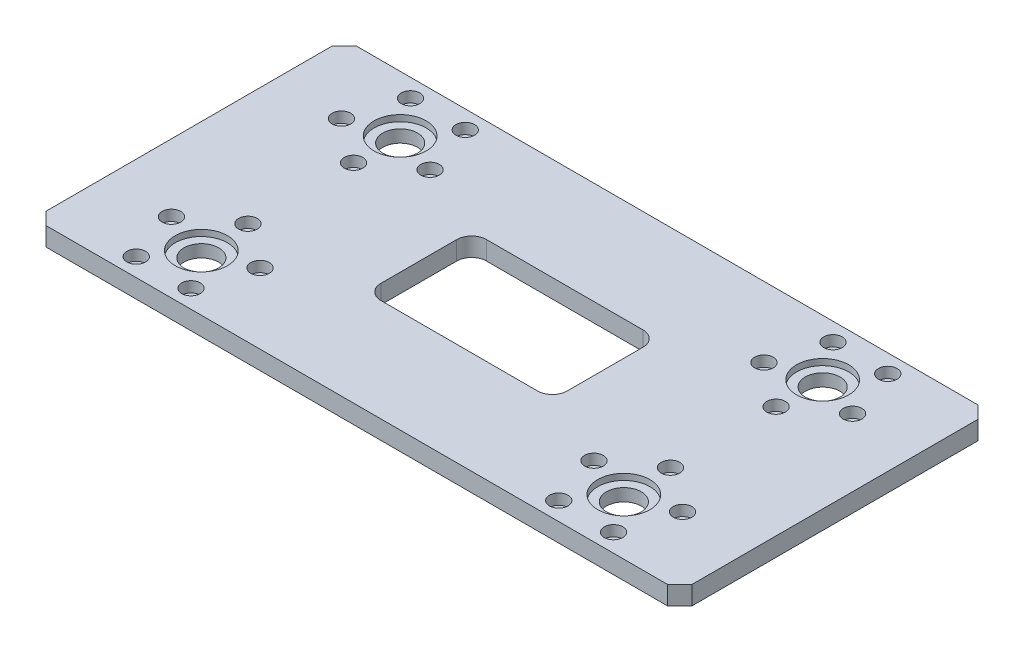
ISO-10303-21;
HEADER;
FILE_DESCRIPTION(('STEP AP214'),'2;1');
FILE_NAME('part.step','',(''),(''),'','','');
FILE_SCHEMA(('AUTOMOTIVE_DESIGN { 1 0 10303 214 1 1 1 1 }'));
ENDSEC;
DATA;
#1=APPLICATION_CONTEXT('core data for automotive mechanical design processes');
#2=APPLICATION_PROTOCOL_DEFINITION('international standard','automotive_design',2000,#1);
#3=PRODUCT_CONTEXT('',#1,'mechanical');
#4=PRODUCT('Part','Part','',(#3));
#5=PRODUCT_RELATED_PRODUCT_CATEGORY('part','',(#4));
#6=PRODUCT_DEFINITION_FORMATION('','',#4);
#7=PRODUCT_DEFINITION_CONTEXT('part definition',#1,'design');
#8=PRODUCT_DEFINITION('design','',#6,#7);
#9=PRODUCT_DEFINITION_SHAPE('','',#8);
#10=(LENGTH_UNIT() NAMED_UNIT(*) SI_UNIT(.MILLI.,.METRE.));
#11=(NAMED_UNIT(*) PLANE_ANGLE_UNIT() SI_UNIT($,.RADIAN.));
#12=(NAMED_UNIT(*) SI_UNIT($,.STERADIAN.) SOLID_ANGLE_UNIT());
#13=UNCERTAINTY_MEASURE_WITH_UNIT(LENGTH_MEASURE(1.E-05),#10,'distance_accuracy_value','');
#14=(GEOMETRIC_REPRESENTATION_CONTEXT(3) GLOBAL_UNCERTAINTY_ASSIGNED_CONTEXT((#13)) GLOBAL_UNIT_ASSIGNED_CONTEXT((#10,
#11,#12)) REPRESENTATION_CONTEXT('',''));
#15=CARTESIAN_POINT('',(0.,0.,0.));
#16=DIRECTION('',(0.,0.,1.));
#17=DIRECTION('',(1.,0.,0.));
#18=AXIS2_PLACEMENT_3D('',#15,#16,#17);
#19=CARTESIAN_POINT('',(0.,15.,0.));
#20=DIRECTION('',(0.,1.,0.));
#21=DIRECTION('',(0.,0.,1.));
#22=AXIS2_PLACEMENT_3D('',#19,#20,#21);
#23=PLANE('',#22);
#24=CARTESIAN_POINT('',(-205.664619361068,15.,68.411862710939));
#25=DIRECTION('',(0.,-1.,0.));
#26=DIRECTION('',(0.95105651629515,0.,0.309016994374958));
#27=AXIS2_PLACEMENT_3D('',#24,#25,#26);
#28=CIRCLE('',#27,7.50000000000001);
#29=CARTESIAN_POINT('',(-198.531695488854,15.,70.7294901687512));
#30=VERTEX_POINT('',#29);
#31=EDGE_CURVE('E281',#30,#30,#28,.T.);
#32=ORIENTED_EDGE('',*,*,#31,.T.);
#33=EDGE_LOOP('',(#32));
#34=FACE_BOUND('',#33,.T.);
#35=CARTESIAN_POINT('',(-192.041946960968,15.,110.33813728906));
#36=DIRECTION('',(0.,-1.,0.));
#37=DIRECTION('',(0.58778525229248,0.,-0.809016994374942));
#38=AXIS2_PLACEMENT_3D('',#35,#36,#37);
#39=CIRCLE('',#38,7.50000000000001);
#40=CARTESIAN_POINT('',(-187.633557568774,15.,104.270509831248));
#41=VERTEX_POINT('',#40);
#42=EDGE_CURVE('E298',#41,#41,#39,.T.);
#43=ORIENTED_EDGE('',*,*,#42,.T.);
#44=EDGE_LOOP('',(#43));
#45=FACE_BOUND('',#44,.T.);
#46=CARTESIAN_POINT('',(-147.958053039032,15.,110.338137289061));
#47=DIRECTION('',(0.,-1.,0.));
#48=DIRECTION('',(-0.587785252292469,0.,-0.809016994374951));
#49=AXIS2_PLACEMENT_3D('',#46,#47,#48);
#50=CIRCLE('',#49,7.50000000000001);
#51=CARTESIAN_POINT('',(-152.366442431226,15.,104.270509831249));
#52=VERTEX_POINT('',#51);
#53=EDGE_CURVE('E310',#52,#52,#50,.T.);
#54=ORIENTED_EDGE('',*,*,#53,.T.);
#55=EDGE_LOOP('',(#54));
#56=FACE_BOUND('',#55,.T.);
#57=CARTESIAN_POINT('',(-134.335380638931,15.,68.4118627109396));
#58=DIRECTION('',(0.,-1.,0.));
#59=DIRECTION('',(-0.951056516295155,0.,0.309016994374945));
#60=AXIS2_PLACEMENT_3D('',#57,#58,#59);
#61=CIRCLE('',#60,7.50000000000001);
#62=CARTESIAN_POINT('',(-141.468304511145,15.,70.7294901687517));
#63=VERTEX_POINT('',#62);
#64=EDGE_CURVE('E322',#63,#63,#61,.T.);
#65=ORIENTED_EDGE('',*,*,#64,.T.);
#66=EDGE_LOOP('',(#65));
#67=FACE_BOUND('',#66,.T.);
#68=CARTESIAN_POINT('',(-170.,15.,42.5));
#69=DIRECTION('',(0.,1.,0.));
#70=DIRECTION('',(0.,0.,1.));
#71=AXIS2_PLACEMENT_3D('',#68,#69,#70);
#72=CIRCLE('',#71,7.50000000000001);
#73=CARTESIAN_POINT('',(-170.,15.,50.));
#74=VERTEX_POINT('',#73);
#75=EDGE_CURVE('E334',#74,#74,#72,.T.);
#76=ORIENTED_EDGE('',*,*,#75,.F.);
#77=EDGE_LOOP('',(#76));
#78=FACE_BOUND('',#77,.T.);
#79=CARTESIAN_POINT('',(-170.,15.,80.));
#80=DIRECTION('',(0.,-1.,0.));
#81=DIRECTION('',(0.,0.,1.));
#82=AXIS2_PLACEMENT_3D('',#79,#80,#81);
#83=CIRCLE('',#82,21.);
#84=CARTESIAN_POINT('',(-170.,15.,101.));
#85=VERTEX_POINT('',#84);
#86=EDGE_CURVE('E350',#85,#85,#83,.T.);
#87=ORIENTED_EDGE('',*,*,#86,.T.);
#88=EDGE_LOOP('',(#87));
#89=FACE_BOUND('',#88,.T.);
#90=CARTESIAN_POINT('',(-205.664619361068,15.,-68.411862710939));
#91=DIRECTION('',(0.,1.,0.));
#92=DIRECTION('',(0.95105651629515,0.,-0.309016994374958));
#93=AXIS2_PLACEMENT_3D('',#90,#91,#92);
#94=CIRCLE('',#93,7.50000000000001);
#95=CARTESIAN_POINT('',(-198.531695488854,15.,-70.7294901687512));
#96=VERTEX_POINT('',#95);
#97=EDGE_CURVE('E356',#96,#96,#94,.T.);
#98=ORIENTED_EDGE('',*,*,#97,.F.);
#99=EDGE_LOOP('',(#98));
#100=FACE_BOUND('',#99,.T.);
#101=CARTESIAN_POINT('',(-192.041946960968,15.,-110.33813728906));
#102=DIRECTION('',(0.,1.,0.));
#103=DIRECTION('',(0.58778525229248,0.,0.809016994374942));
#104=AXIS2_PLACEMENT_3D('',#101,#102,#103);
#105=CIRCLE('',#104,7.50000000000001);
#106=CARTESIAN_POINT('',(-187.633557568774,15.,-104.270509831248));
#107=VERTEX_POINT('',#106);
#108=EDGE_CURVE('E370',#107,#107,#105,.T.);
#109=ORIENTED_EDGE('',*,*,#108,.F.);
#110=EDGE_LOOP('',(#109));
#111=FACE_BOUND('',#110,.T.);
#112=CARTESIAN_POINT('',(-147.958053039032,15.,-110.338137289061));
#113=DIRECTION('',(0.,1.,0.));
#114=DIRECTION('',(-0.587785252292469,0.,0.809016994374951));
#115=AXIS2_PLACEMENT_3D('',#112,#113,#114);
#116=CIRCLE('',#115,7.50000000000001);
#117=CARTESIAN_POINT('',(-152.366442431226,15.,-104.270509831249));
#118=VERTEX_POINT('',#117);
#119=EDGE_CURVE('E382',#118,#118,#116,.T.);
#120=ORIENTED_EDGE('',*,*,#119,.F.);
#121=EDGE_LOOP('',(#120));
#122=FACE_BOUND('',#121,.T.);
#123=CARTESIAN_POINT('',(-134.335380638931,15.,-68.4118627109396));
#124=DIRECTION('',(0.,1.,0.));
#125=DIRECTION('',(-0.951056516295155,0.,-0.309016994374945));
#126=AXIS2_PLACEMENT_3D('',#123,#124,#125);
#127=CIRCLE('',#126,7.50000000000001);
#128=CARTESIAN_POINT('',(-141.468304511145,15.,-70.7294901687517));
#129=VERTEX_POINT('',#128);
#130=EDGE_CURVE('E394',#129,#129,#127,.T.);
#131=ORIENTED_EDGE('',*,*,#130,.F.);
#132=EDGE_LOOP('',(#131));
#133=FACE_BOUND('',#132,.T.);
#134=CARTESIAN_POINT('',(-170.,15.,-42.5));
#135=DIRECTION('',(0.,1.,0.));
#136=DIRECTION('',(0.,0.,1.));
#137=AXIS2_PLACEMENT_3D('',#134,#135,#136);
#138=CIRCLE('',#137,7.50000000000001);
#139=CARTESIAN_POINT('',(-170.,15.,-35.));
#140=VERTEX_POINT('',#139);
#141=EDGE_CURVE('E406',#140,#140,#138,.T.);
#142=ORIENTED_EDGE('',*,*,#141,.F.);
#143=EDGE_LOOP('',(#142));
#144=FACE_BOUND('',#143,.T.);
#145=CARTESIAN_POINT('',(-170.,15.,-80.));
#146=DIRECTION('',(0.,1.,0.));
#147=DIRECTION('',(0.,0.,-1.));
#148=AXIS2_PLACEMENT_3D('',#145,#146,#147);
#149=CIRCLE('',#148,21.);
#150=CARTESIAN_POINT('',(-170.,15.,-101.));
#151=VERTEX_POINT('',#150);
#152=EDGE_CURVE('E422',#151,#151,#149,.T.);
#153=ORIENTED_EDGE('',*,*,#152,.F.);
#154=EDGE_LOOP('',(#153));
#155=FACE_BOUND('',#154,.T.);
#156=CARTESIAN_POINT('',(205.664619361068,15.,-68.411862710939));
#157=DIRECTION('',(0.,-1.,0.));
#158=DIRECTION('',(-0.95105651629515,0.,-0.309016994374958));
#159=AXIS2_PLACEMENT_3D('',#156,#157,#158);
#160=CIRCLE('',#159,7.50000000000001);
#161=CARTESIAN_POINT('',(198.531695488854,15.,-70.7294901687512));
#162=VERTEX_POINT('',#161);
#163=EDGE_CURVE('E428',#162,#162,#160,.T.);
#164=ORIENTED_EDGE('',*,*,#163,.T.);
#165=EDGE_LOOP('',(#164));
#166=FACE_BOUND('',#165,.T.);
#167=CARTESIAN_POINT('',(192.041946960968,15.,-110.33813728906));
#168=DIRECTION('',(0.,-1.,0.));
#169=DIRECTION('',(-0.58778525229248,0.,0.809016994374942));
#170=AXIS2_PLACEMENT_3D('',#167,#168,#169);
#171=CIRCLE('',#170,7.50000000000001);
#172=CARTESIAN_POINT('',(187.633557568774,15.,-104.270509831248));
#173=VERTEX_POINT('',#172);
#174=EDGE_CURVE('E442',#173,#173,#171,.T.);
#175=ORIENTED_EDGE('',*,*,#174,.T.);
#176=EDGE_LOOP('',(#175));
#177=FACE_BOUND('',#176,.T.);
#178=CARTESIAN_POINT('',(147.958053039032,15.,-110.338137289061));
#179=DIRECTION('',(0.,-1.,0.));
#180=DIRECTION('',(0.587785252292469,0.,0.809016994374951));
#181=AXIS2_PLACEMENT_3D('',#178,#179,#180);
#182=CIRCLE('',#181,7.50000000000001);
#183=CARTESIAN_POINT('',(152.366442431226,15.,-104.270509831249));
#184=VERTEX_POINT('',#183);
#185=EDGE_CURVE('E454',#184,#184,#182,.T.);
#186=ORIENTED_EDGE('',*,*,#185,.T.);
#187=EDGE_LOOP('',(#186));
#188=FACE_BOUND('',#187,.T.);
#189=CARTESIAN_POINT('',(134.335380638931,15.,-68.4118627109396));
#190=DIRECTION('',(0.,-1.,0.));
#191=DIRECTION('',(0.951056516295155,0.,-0.309016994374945));
#192=AXIS2_PLACEMENT_3D('',#189,#190,#191);
#193=CIRCLE('',#192,7.50000000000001);
#194=CARTESIAN_POINT('',(141.468304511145,15.,-70.7294901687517));
#195=VERTEX_POINT('',#194);
#196=EDGE_CURVE('E466',#195,#195,#193,.T.);
#197=ORIENTED_EDGE('',*,*,#196,.T.);
#198=EDGE_LOOP('',(#197));
#199=FACE_BOUND('',#198,.T.);
#200=CARTESIAN_POINT('',(170.,15.,-42.5));
#201=DIRECTION('',(0.,1.,0.));
#202=DIRECTION('',(0.,0.,1.));
#203=AXIS2_PLACEMENT_3D('',#200,#201,#202);
#204=CIRCLE('',#203,7.50000000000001);
#205=CARTESIAN_POINT('',(170.,15.,-35.));
#206=VERTEX_POINT('',#205);
#207=EDGE_CURVE('E478',#206,#206,#204,.T.);
#208=ORIENTED_EDGE('',*,*,#207,.F.);
#209=EDGE_LOOP('',(#208));
#210=FACE_BOUND('',#209,.T.);
#211=CARTESIAN_POINT('',(170.,15.,-80.));
#212=DIRECTION('',(0.,-1.,0.));
#213=DIRECTION('',(0.,0.,-1.));
#214=AXIS2_PLACEMENT_3D('',#211,#212,#213);
#215=CIRCLE('',#214,21.);
#216=CARTESIAN_POINT('',(170.,15.,-101.));
#217=VERTEX_POINT('',#216);
#218=EDGE_CURVE('E494',#217,#217,#215,.T.);
#219=ORIENTED_EDGE('',*,*,#218,.T.);
#220=EDGE_LOOP('',(#219));
#221=FACE_BOUND('',#220,.T.);
#222=CARTESIAN_POINT('',(205.664619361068,15.,68.411862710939));
#223=DIRECTION('',(0.,1.,0.));
#224=DIRECTION('',(-0.95105651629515,0.,0.309016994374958));
#225=AXIS2_PLACEMENT_3D('',#222,#223,#224);
#226=CIRCLE('',#225,7.50000000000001);
#227=CARTESIAN_POINT('',(198.531695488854,15.,70.7294901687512));
#228=VERTEX_POINT('',#227);
#229=EDGE_CURVE('E500',#228,#228,#226,.T.);
#230=ORIENTED_EDGE('',*,*,#229,.F.);
#231=EDGE_LOOP('',(#230));
#232=FACE_BOUND('',#231,.T.);
#233=CARTESIAN_POINT('',(192.041946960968,15.,110.33813728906));
#234=DIRECTION('',(0.,1.,0.));
#235=DIRECTION('',(-0.58778525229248,0.,-0.809016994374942));
#236=AXIS2_PLACEMENT_3D('',#233,#234,#235);
#237=CIRCLE('',#236,7.50000000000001);
#238=CARTESIAN_POINT('',(187.633557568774,15.,104.270509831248));
#239=VERTEX_POINT('',#238);
#240=EDGE_CURVE('E514',#239,#239,#237,.T.);
#241=ORIENTED_EDGE('',*,*,#240,.F.);
#242=EDGE_LOOP('',(#241));
#243=FACE_BOUND('',#242,.T.);
#244=CARTESIAN_POINT('',(147.958053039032,15.,110.338137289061));
#245=DIRECTION('',(0.,1.,0.));
#246=DIRECTION('',(0.587785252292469,0.,-0.809016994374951));
#247=AXIS2_PLACEMENT_3D('',#244,#245,#246);
#248=CIRCLE('',#247,7.50000000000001);
#249=CARTESIAN_POINT('',(152.366442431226,15.,104.270509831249));
#250=VERTEX_POINT('',#249);
#251=EDGE_CURVE('E526',#250,#250,#248,.T.);
#252=ORIENTED_EDGE('',*,*,#251,.F.);
#253=EDGE_LOOP('',(#252));
#254=FACE_BOUND('',#253,.T.);
#255=CARTESIAN_POINT('',(134.335380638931,15.,68.4118627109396));
#256=DIRECTION('',(0.,1.,0.));
#257=DIRECTION('',(0.951056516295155,0.,0.309016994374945));
#258=AXIS2_PLACEMENT_3D('',#255,#256,#257);
#259=CIRCLE('',#258,7.50000000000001);
#260=CARTESIAN_POINT('',(141.468304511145,15.,70.7294901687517));
#261=VERTEX_POINT('',#260);
#262=EDGE_CURVE('E538',#261,#261,#259,.T.);
#263=ORIENTED_EDGE('',*,*,#262,.F.);
#264=EDGE_LOOP('',(#263));
#265=FACE_BOUND('',#264,.T.);
#266=CARTESIAN_POINT('',(170.,15.,42.5));
#267=DIRECTION('',(0.,1.,0.));
#268=DIRECTION('',(0.,0.,1.));
#269=AXIS2_PLACEMENT_3D('',#266,#267,#268);
#270=CIRCLE('',#269,7.50000000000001);
#271=CARTESIAN_POINT('',(170.,15.,50.));
#272=VERTEX_POINT('',#271);
#273=EDGE_CURVE('E550',#272,#272,#270,.T.);
#274=ORIENTED_EDGE('',*,*,#273,.F.);
#275=EDGE_LOOP('',(#274));
#276=FACE_BOUND('',#275,.T.);
#277=CARTESIAN_POINT('',(170.,15.,80.));
#278=DIRECTION('',(0.,1.,0.));
#279=DIRECTION('',(0.,0.,1.));
#280=AXIS2_PLACEMENT_3D('',#277,#278,#279);
#281=CIRCLE('',#280,21.);
#282=CARTESIAN_POINT('',(170.,15.,101.));
#283=VERTEX_POINT('',#282);
#284=EDGE_CURVE('E566',#283,#283,#281,.T.);
#285=ORIENTED_EDGE('',*,*,#284,.F.);
#286=EDGE_LOOP('',(#285));
#287=FACE_BOUND('',#286,.T.);
#288=DIRECTION('',(0.,0.,-1.));
#289=VECTOR('',#288,1.);
#290=CARTESIAN_POINT('',(260.,15.,-125.));
#291=LINE('',#290,#289);
#292=CARTESIAN_POINT('',(260.,15.,115.));
#293=VERTEX_POINT('',#292);
#294=CARTESIAN_POINT('',(260.,15.,-115.));
#295=VERTEX_POINT('',#294);
#296=EDGE_CURVE('E577',#293,#295,#291,.T.);
#297=ORIENTED_EDGE('',*,*,#296,.T.);
#298=DIRECTION('',(0.707106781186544,0.,0.707106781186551));
#299=VECTOR('',#298,1.);
#300=CARTESIAN_POINT('',(187.500000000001,15.,-187.499999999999));
#301=LINE('',#300,#299);
#302=CARTESIAN_POINT('',(250.,15.,-125.));
#303=VERTEX_POINT('',#302);
#304=EDGE_CURVE('E210',#295,#303,#301,.F.);
#305=ORIENTED_EDGE('',*,*,#304,.T.);
#306=DIRECTION('',(-1.,0.,0.));
#307=VECTOR('',#306,1.);
#308=CARTESIAN_POINT('',(-260.,15.,-125.));
#309=LINE('',#308,#307);
#310=CARTESIAN_POINT('',(-250.,15.,-125.));
#311=VERTEX_POINT('',#310);
#312=EDGE_CURVE('E179',#303,#311,#309,.T.);
#313=ORIENTED_EDGE('',*,*,#312,.T.);
#314=DIRECTION('',(0.707106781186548,0.,-0.707106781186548));
#315=VECTOR('',#314,1.);
#316=CARTESIAN_POINT('',(-187.5,15.,-187.5));
#317=LINE('',#316,#315);
#318=CARTESIAN_POINT('',(-260.,15.,-115.));
#319=VERTEX_POINT('',#318);
#320=EDGE_CURVE('E206',#311,#319,#317,.F.);
#321=ORIENTED_EDGE('',*,*,#320,.T.);
#322=DIRECTION('',(0.,0.,1.));
#323=VECTOR('',#322,1.);
#324=CARTESIAN_POINT('',(-260.,15.,-125.));
#325=LINE('',#324,#323);
#326=CARTESIAN_POINT('',(-260.,15.,115.));
#327=VERTEX_POINT('',#326);
#328=EDGE_CURVE('E187',#319,#327,#325,.T.);
#329=ORIENTED_EDGE('',*,*,#328,.T.);
#330=DIRECTION('',(-0.707106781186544,0.,-0.707106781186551));
#331=VECTOR('',#330,1.);
#332=CARTESIAN_POINT('',(-187.500000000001,15.,187.499999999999));
#333=LINE('',#332,#331);
#334=CARTESIAN_POINT('',(-250.,15.,125.));
#335=VERTEX_POINT('',#334);
#336=EDGE_CURVE('E204',#327,#335,#333,.F.);
#337=ORIENTED_EDGE('',*,*,#336,.T.);
#338=DIRECTION('',(1.,0.,0.));
#339=VECTOR('',#338,1.);
#340=CARTESIAN_POINT('',(-260.,15.,125.));
#341=LINE('',#340,#339);
#342=CARTESIAN_POINT('',(250.,15.,125.));
#343=VERTEX_POINT('',#342);
#344=EDGE_CURVE('E191',#335,#343,#341,.T.);
#345=ORIENTED_EDGE('',*,*,#344,.T.);
#346=DIRECTION('',(-0.70710678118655,0.,0.707106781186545));
#347=VECTOR('',#346,1.);
#348=CARTESIAN_POINT('',(187.499999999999,15.,187.5));
#349=LINE('',#348,#347);
#350=EDGE_CURVE('E208',#343,#293,#349,.F.);
#351=ORIENTED_EDGE('',*,*,#350,.T.);
#352=EDGE_LOOP('',(#297,#305,#313,#321,#329,#337,#345,#351));
#353=FACE_BOUND('',#352,.T.);
#354=DIRECTION('',(-1.,0.,0.));
#355=VECTOR('',#354,1.);
#356=CARTESIAN_POINT('',(-75.,15.,-42.5));
#357=LINE('',#356,#355);
#358=CARTESIAN_POINT('',(63.,15.,-42.5));
#359=VERTEX_POINT('',#358);
#360=CARTESIAN_POINT('',(-63.,15.,-42.5));
#361=VERTEX_POINT('',#360);
#362=EDGE_CURVE('E269',#359,#361,#357,.T.);
#363=ORIENTED_EDGE('',*,*,#362,.F.);
#364=CARTESIAN_POINT('',(63.,15.,-30.5));
#365=DIRECTION('',(0.,1.,0.));
#366=DIRECTION('',(0.,0.,1.));
#367=AXIS2_PLACEMENT_3D('',#364,#365,#366);
#368=CIRCLE('',#367,12.);
#369=CARTESIAN_POINT('',(75.,15.,-30.5));
#370=VERTEX_POINT('',#369);
#371=EDGE_CURVE('E251',#359,#370,#368,.F.);
#372=ORIENTED_EDGE('',*,*,#371,.T.);
#373=DIRECTION('',(0.,0.,-1.));
#374=VECTOR('',#373,1.);
#375=CARTESIAN_POINT('',(75.,15.,-42.5));
#376=LINE('',#375,#374);
#377=CARTESIAN_POINT('',(75.,15.,30.5));
#378=VERTEX_POINT('',#377);
#379=EDGE_CURVE('E272',#378,#370,#376,.T.);
#380=ORIENTED_EDGE('',*,*,#379,.F.);
#381=CARTESIAN_POINT('',(63.,15.,30.5));
#382=DIRECTION('',(0.,1.,0.));
#383=DIRECTION('',(0.,0.,1.));
#384=AXIS2_PLACEMENT_3D('',#381,#382,#383);
#385=CIRCLE('',#384,12.);
#386=CARTESIAN_POINT('',(63.,15.,42.5));
#387=VERTEX_POINT('',#386);
#388=EDGE_CURVE('E247',#378,#387,#385,.F.);
#389=ORIENTED_EDGE('',*,*,#388,.T.);
#390=DIRECTION('',(1.,0.,0.));
#391=VECTOR('',#390,1.);
#392=CARTESIAN_POINT('',(-75.,15.,42.5));
#393=LINE('',#392,#391);
#394=CARTESIAN_POINT('',(-63.,15.,42.5));
#395=VERTEX_POINT('',#394);
#396=EDGE_CURVE('E274',#395,#387,#393,.T.);
#397=ORIENTED_EDGE('',*,*,#396,.F.);
#398=CARTESIAN_POINT('',(-63.,15.,30.5));
#399=DIRECTION('',(0.,1.,0.));
#400=DIRECTION('',(0.,0.,1.));
#401=AXIS2_PLACEMENT_3D('',#398,#399,#400);
#402=CIRCLE('',#401,12.);
#403=CARTESIAN_POINT('',(-75.,15.,30.5));
#404=VERTEX_POINT('',#403);
#405=EDGE_CURVE('E243',#395,#404,#402,.F.);
#406=ORIENTED_EDGE('',*,*,#405,.T.);
#407=DIRECTION('',(0.,0.,1.));
#408=VECTOR('',#407,1.);
#409=CARTESIAN_POINT('',(-75.,15.,-42.5));
#410=LINE('',#409,#408);
#411=CARTESIAN_POINT('',(-75.,15.,-30.5));
#412=VERTEX_POINT('',#411);
#413=EDGE_CURVE('E271',#412,#404,#410,.T.);
#414=ORIENTED_EDGE('',*,*,#413,.F.);
#415=CARTESIAN_POINT('',(-63.,15.,-30.5));
#416=DIRECTION('',(0.,1.,0.));
#417=DIRECTION('',(0.,0.,1.));
#418=AXIS2_PLACEMENT_3D('',#415,#416,#417);
#419=CIRCLE('',#418,12.);
#420=EDGE_CURVE('E13',#412,#361,#419,.F.);
#421=ORIENTED_EDGE('',*,*,#420,.T.);
#422=EDGE_LOOP('',(#363,#372,#380,#389,#397,#406,#414,#421));
#423=FACE_BOUND('',#422,.T.);
#424=ADVANCED_FACE('F46',(#34,#45,#56,#67,#78,#89,#100,#111,#122,#133,#144,#155,#166,#177,#188,
#199,#210,#221,#232,#243,#254,#265,#276,#287,#353,#423),#23,.T.);
#425=CARTESIAN_POINT('',(0.,0.,0.));
#426=DIRECTION('',(0.,1.,0.));
#427=DIRECTION('',(0.,0.,1.));
#428=AXIS2_PLACEMENT_3D('',#425,#426,#427);
#429=PLANE('',#428);
#430=DIRECTION('',(-1.,0.,0.));
#431=VECTOR('',#430,1.);
#432=CARTESIAN_POINT('',(-260.,0.,-125.));
#433=LINE('',#432,#431);
#434=CARTESIAN_POINT('',(250.,0.,-125.));
#435=VERTEX_POINT('',#434);
#436=CARTESIAN_POINT('',(-250.,0.,-125.));
#437=VERTEX_POINT('',#436);
#438=EDGE_CURVE('E176',#435,#437,#433,.T.);
#439=ORIENTED_EDGE('',*,*,#438,.F.);
#440=DIRECTION('',(-0.707106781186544,0.,-0.707106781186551));
#441=VECTOR('',#440,1.);
#442=CARTESIAN_POINT('',(250.,0.,-125.));
#443=LINE('',#442,#441);
#444=CARTESIAN_POINT('',(260.,0.,-115.));
#445=VERTEX_POINT('',#444);
#446=EDGE_CURVE('E159',#435,#445,#443,.F.);
#447=ORIENTED_EDGE('',*,*,#446,.T.);
#448=DIRECTION('',(0.,0.,-1.));
#449=VECTOR('',#448,1.);
#450=CARTESIAN_POINT('',(260.,0.,-125.));
#451=LINE('',#450,#449);
#452=CARTESIAN_POINT('',(260.,0.,115.));
#453=VERTEX_POINT('',#452);
#454=EDGE_CURVE('E188',#453,#445,#451,.T.);
#455=ORIENTED_EDGE('',*,*,#454,.F.);
#456=DIRECTION('',(0.70710678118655,0.,-0.707106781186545));
#457=VECTOR('',#456,1.);
#458=CARTESIAN_POINT('',(260.,0.,115.));
#459=LINE('',#458,#457);
#460=CARTESIAN_POINT('',(250.,0.,125.));
#461=VERTEX_POINT('',#460);
#462=EDGE_CURVE('E170',#453,#461,#459,.F.);
#463=ORIENTED_EDGE('',*,*,#462,.T.);
#464=DIRECTION('',(1.,0.,0.));
#465=VECTOR('',#464,1.);
#466=CARTESIAN_POINT('',(-260.,0.,125.));
#467=LINE('',#466,#465);
#468=CARTESIAN_POINT('',(-250.,0.,125.));
#469=VERTEX_POINT('',#468);
#470=EDGE_CURVE('E193',#469,#461,#467,.T.);
#471=ORIENTED_EDGE('',*,*,#470,.F.);
#472=DIRECTION('',(0.707106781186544,0.,0.707106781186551));
#473=VECTOR('',#472,1.);
#474=CARTESIAN_POINT('',(-250.,0.,125.));
#475=LINE('',#474,#473);
#476=CARTESIAN_POINT('',(-260.,0.,115.));
#477=VERTEX_POINT('',#476);
#478=EDGE_CURVE('E180',#469,#477,#475,.F.);
#479=ORIENTED_EDGE('',*,*,#478,.T.);
#480=DIRECTION('',(0.,0.,1.));
#481=VECTOR('',#480,1.);
#482=CARTESIAN_POINT('',(-260.,0.,-125.));
#483=LINE('',#482,#481);
#484=CARTESIAN_POINT('',(-260.,0.,-115.));
#485=VERTEX_POINT('',#484);
#486=EDGE_CURVE('E572',#485,#477,#483,.T.);
#487=ORIENTED_EDGE('',*,*,#486,.F.);
#488=DIRECTION('',(-0.707106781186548,0.,0.707106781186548));
#489=VECTOR('',#488,1.);
#490=CARTESIAN_POINT('',(-260.,0.,-115.));
#491=LINE('',#490,#489);
#492=EDGE_CURVE('E186',#485,#437,#491,.F.);
#493=ORIENTED_EDGE('',*,*,#492,.T.);
#494=EDGE_LOOP('',(#439,#447,#455,#463,#471,#479,#487,#493));
#495=FACE_BOUND('',#494,.T.);
#496=CARTESIAN_POINT('',(170.,0.,80.));
#497=DIRECTION('',(0.,1.,0.));
#498=DIRECTION('',(0.,0.,1.));
#499=AXIS2_PLACEMENT_3D('',#496,#497,#498);
#500=CIRCLE('',#499,14.);
#501=CARTESIAN_POINT('',(170.,0.,94.));
#502=VERTEX_POINT('',#501);
#503=EDGE_CURVE('E563',#502,#502,#500,.T.);
#504=ORIENTED_EDGE('',*,*,#503,.T.);
#505=EDGE_LOOP('',(#504));
#506=FACE_BOUND('',#505,.T.);
#507=CARTESIAN_POINT('',(170.,0.,42.5));
#508=DIRECTION('',(0.,1.,0.));
#509=DIRECTION('',(0.,0.,1.));
#510=AXIS2_PLACEMENT_3D('',#507,#508,#509);
#511=CIRCLE('',#510,4.5);
#512=CARTESIAN_POINT('',(170.,0.,47.));
#513=VERTEX_POINT('',#512);
#514=EDGE_CURVE('E559',#513,#513,#511,.T.);
#515=ORIENTED_EDGE('',*,*,#514,.T.);
#516=EDGE_LOOP('',(#515));
#517=FACE_BOUND('',#516,.T.);
#518=CARTESIAN_POINT('',(134.335380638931,0.,68.4118627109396));
#519=DIRECTION('',(0.,1.,0.));
#520=DIRECTION('',(0.951056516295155,0.,0.309016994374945));
#521=AXIS2_PLACEMENT_3D('',#518,#519,#520);
#522=CIRCLE('',#521,4.5);
#523=CARTESIAN_POINT('',(138.61513496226,0.,69.8024391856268));
#524=VERTEX_POINT('',#523);
#525=EDGE_CURVE('E541',#524,#524,#522,.T.);
#526=ORIENTED_EDGE('',*,*,#525,.T.);
#527=EDGE_LOOP('',(#526));
#528=FACE_BOUND('',#527,.T.);
#529=CARTESIAN_POINT('',(147.958053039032,0.,110.338137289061));
#530=DIRECTION('',(0.,1.,0.));
#531=DIRECTION('',(0.587785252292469,0.,-0.809016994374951));
#532=AXIS2_PLACEMENT_3D('',#529,#530,#531);
#533=CIRCLE('',#532,4.5);
#534=CARTESIAN_POINT('',(150.603086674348,0.,106.697560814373));
#535=VERTEX_POINT('',#534);
#536=EDGE_CURVE('E529',#535,#535,#533,.T.);
#537=ORIENTED_EDGE('',*,*,#536,.T.);
#538=EDGE_LOOP('',(#537));
#539=FACE_BOUND('',#538,.T.);
#540=CARTESIAN_POINT('',(192.041946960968,0.,110.33813728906));
#541=DIRECTION('',(0.,1.,0.));
#542=DIRECTION('',(-0.58778525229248,0.,-0.809016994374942));
#543=AXIS2_PLACEMENT_3D('',#540,#541,#542);
#544=CIRCLE('',#543,4.5);
#545=CARTESIAN_POINT('',(189.396913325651,0.,106.697560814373));
#546=VERTEX_POINT('',#545);
#547=EDGE_CURVE('E517',#546,#546,#544,.T.);
#548=ORIENTED_EDGE('',*,*,#547,.T.);
#549=EDGE_LOOP('',(#548));
#550=FACE_BOUND('',#549,.T.);
#551=CARTESIAN_POINT('',(205.664619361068,0.,68.411862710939));
#552=DIRECTION('',(0.,1.,0.));
#553=DIRECTION('',(-0.95105651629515,0.,0.309016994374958));
#554=AXIS2_PLACEMENT_3D('',#551,#552,#553);
#555=CIRCLE('',#554,4.5);
#556=CARTESIAN_POINT('',(201.38486503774,0.,69.8024391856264));
#557=VERTEX_POINT('',#556);
#558=EDGE_CURVE('E505',#557,#557,#555,.T.);
#559=ORIENTED_EDGE('',*,*,#558,.T.);
#560=EDGE_LOOP('',(#559));
#561=FACE_BOUND('',#560,.T.);
#562=CARTESIAN_POINT('',(170.,0.,-80.));
#563=DIRECTION('',(0.,-1.,0.));
#564=DIRECTION('',(0.,0.,-1.));
#565=AXIS2_PLACEMENT_3D('',#562,#563,#564);
#566=CIRCLE('',#565,14.);
#567=CARTESIAN_POINT('',(170.,0.,-94.));
#568=VERTEX_POINT('',#567);
#569=EDGE_CURVE('E491',#568,#568,#566,.T.);
#570=ORIENTED_EDGE('',*,*,#569,.F.);
#571=EDGE_LOOP('',(#570));
#572=FACE_BOUND('',#571,.T.);
#573=CARTESIAN_POINT('',(170.,0.,-42.5));
#574=DIRECTION('',(0.,1.,0.));
#575=DIRECTION('',(0.,0.,1.));
#576=AXIS2_PLACEMENT_3D('',#573,#574,#575);
#577=CIRCLE('',#576,4.5);
#578=CARTESIAN_POINT('',(170.,0.,-38.));
#579=VERTEX_POINT('',#578);
#580=EDGE_CURVE('E487',#579,#579,#577,.T.);
#581=ORIENTED_EDGE('',*,*,#580,.T.);
#582=EDGE_LOOP('',(#581));
#583=FACE_BOUND('',#582,.T.);
#584=CARTESIAN_POINT('',(134.335380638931,0.,-68.4118627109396));
#585=DIRECTION('',(0.,-1.,0.));
#586=DIRECTION('',(0.951056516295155,0.,-0.309016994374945));
#587=AXIS2_PLACEMENT_3D('',#584,#585,#586);
#588=CIRCLE('',#587,4.5);
#589=CARTESIAN_POINT('',(138.61513496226,0.,-69.8024391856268));
#590=VERTEX_POINT('',#589);
#591=EDGE_CURVE('E469',#590,#590,#588,.T.);
#592=ORIENTED_EDGE('',*,*,#591,.F.);
#593=EDGE_LOOP('',(#592));
#594=FACE_BOUND('',#593,.T.);
#595=CARTESIAN_POINT('',(147.958053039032,0.,-110.338137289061));
#596=DIRECTION('',(0.,-1.,0.));
#597=DIRECTION('',(0.587785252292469,0.,0.809016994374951));
#598=AXIS2_PLACEMENT_3D('',#595,#596,#597);
#599=CIRCLE('',#598,4.5);
#600=CARTESIAN_POINT('',(150.603086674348,0.,-106.697560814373));
#601=VERTEX_POINT('',#600);
#602=EDGE_CURVE('E457',#601,#601,#599,.T.);
#603=ORIENTED_EDGE('',*,*,#602,.F.);
#604=EDGE_LOOP('',(#603));
#605=FACE_BOUND('',#604,.T.);
#606=CARTESIAN_POINT('',(192.041946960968,0.,-110.33813728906));
#607=DIRECTION('',(0.,-1.,0.));
#608=DIRECTION('',(-0.58778525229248,0.,0.809016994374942));
#609=AXIS2_PLACEMENT_3D('',#606,#607,#608);
#610=CIRCLE('',#609,4.5);
#611=CARTESIAN_POINT('',(189.396913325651,0.,-106.697560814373));
#612=VERTEX_POINT('',#611);
#613=EDGE_CURVE('E445',#612,#612,#610,.T.);
#614=ORIENTED_EDGE('',*,*,#613,.F.);
#615=EDGE_LOOP('',(#614));
#616=FACE_BOUND('',#615,.T.);
#617=CARTESIAN_POINT('',(205.664619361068,0.,-68.411862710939));
#618=DIRECTION('',(0.,-1.,0.));
#619=DIRECTION('',(-0.95105651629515,0.,-0.309016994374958));
#620=AXIS2_PLACEMENT_3D('',#617,#618,#619);
#621=CIRCLE('',#620,4.5);
#622=CARTESIAN_POINT('',(201.38486503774,0.,-69.8024391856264));
#623=VERTEX_POINT('',#622);
#624=EDGE_CURVE('E433',#623,#623,#621,.T.);
#625=ORIENTED_EDGE('',*,*,#624,.F.);
#626=EDGE_LOOP('',(#625));
#627=FACE_BOUND('',#626,.T.);
#628=CARTESIAN_POINT('',(-170.,0.,-80.));
#629=DIRECTION('',(0.,1.,0.));
#630=DIRECTION('',(0.,0.,-1.));
#631=AXIS2_PLACEMENT_3D('',#628,#629,#630);
#632=CIRCLE('',#631,14.);
#633=CARTESIAN_POINT('',(-170.,0.,-94.));
#634=VERTEX_POINT('',#633);
#635=EDGE_CURVE('E419',#634,#634,#632,.T.);
#636=ORIENTED_EDGE('',*,*,#635,.T.);
#637=EDGE_LOOP('',(#636));
#638=FACE_BOUND('',#637,.T.);
#639=CARTESIAN_POINT('',(-170.,0.,-42.5));
#640=DIRECTION('',(0.,1.,0.));
#641=DIRECTION('',(0.,0.,1.));
#642=AXIS2_PLACEMENT_3D('',#639,#640,#641);
#643=CIRCLE('',#642,4.5);
#644=CARTESIAN_POINT('',(-170.,0.,-38.));
#645=VERTEX_POINT('',#644);
#646=EDGE_CURVE('E415',#645,#645,#643,.T.);
#647=ORIENTED_EDGE('',*,*,#646,.T.);
#648=EDGE_LOOP('',(#647));
#649=FACE_BOUND('',#648,.T.);
#650=CARTESIAN_POINT('',(-134.335380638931,0.,-68.4118627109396));
#651=DIRECTION('',(0.,1.,0.));
#652=DIRECTION('',(-0.951056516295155,0.,-0.309016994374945));
#653=AXIS2_PLACEMENT_3D('',#650,#651,#652);
#654=CIRCLE('',#653,4.5);
#655=CARTESIAN_POINT('',(-138.61513496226,0.,-69.8024391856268));
#656=VERTEX_POINT('',#655);
#657=EDGE_CURVE('E397',#656,#656,#654,.T.);
#658=ORIENTED_EDGE('',*,*,#657,.T.);
#659=EDGE_LOOP('',(#658));
#660=FACE_BOUND('',#659,.T.);
#661=CARTESIAN_POINT('',(-147.958053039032,0.,-110.338137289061));
#662=DIRECTION('',(0.,1.,0.));
#663=DIRECTION('',(-0.587785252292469,0.,0.809016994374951));
#664=AXIS2_PLACEMENT_3D('',#661,#662,#663);
#665=CIRCLE('',#664,4.5);
#666=CARTESIAN_POINT('',(-150.603086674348,0.,-106.697560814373));
#667=VERTEX_POINT('',#666);
#668=EDGE_CURVE('E385',#667,#667,#665,.T.);
#669=ORIENTED_EDGE('',*,*,#668,.T.);
#670=EDGE_LOOP('',(#669));
#671=FACE_BOUND('',#670,.T.);
#672=CARTESIAN_POINT('',(-192.041946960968,0.,-110.33813728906));
#673=DIRECTION('',(0.,1.,0.));
#674=DIRECTION('',(0.58778525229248,0.,0.809016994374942));
#675=AXIS2_PLACEMENT_3D('',#672,#673,#674);
#676=CIRCLE('',#675,4.5);
#677=CARTESIAN_POINT('',(-189.396913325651,0.,-106.697560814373));
#678=VERTEX_POINT('',#677);
#679=EDGE_CURVE('E373',#678,#678,#676,.T.);
#680=ORIENTED_EDGE('',*,*,#679,.T.);
#681=EDGE_LOOP('',(#680));
#682=FACE_BOUND('',#681,.T.);
#683=CARTESIAN_POINT('',(-205.664619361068,0.,-68.411862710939));
#684=DIRECTION('',(0.,1.,0.));
#685=DIRECTION('',(0.95105651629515,0.,-0.309016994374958));
#686=AXIS2_PLACEMENT_3D('',#683,#684,#685);
#687=CIRCLE('',#686,4.5);
#688=CARTESIAN_POINT('',(-201.38486503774,0.,-69.8024391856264));
#689=VERTEX_POINT('',#688);
#690=EDGE_CURVE('E361',#689,#689,#687,.T.);
#691=ORIENTED_EDGE('',*,*,#690,.T.);
#692=EDGE_LOOP('',(#691));
#693=FACE_BOUND('',#692,.T.);
#694=CARTESIAN_POINT('',(-170.,0.,80.));
#695=DIRECTION('',(0.,-1.,0.));
#696=DIRECTION('',(0.,0.,1.));
#697=AXIS2_PLACEMENT_3D('',#694,#695,#696);
#698=CIRCLE('',#697,14.);
#699=CARTESIAN_POINT('',(-170.,0.,94.));
#700=VERTEX_POINT('',#699);
#701=EDGE_CURVE('E347',#700,#700,#698,.T.);
#702=ORIENTED_EDGE('',*,*,#701,.F.);
#703=EDGE_LOOP('',(#702));
#704=FACE_BOUND('',#703,.T.);
#705=CARTESIAN_POINT('',(-170.,0.,42.5));
#706=DIRECTION('',(0.,1.,0.));
#707=DIRECTION('',(0.,0.,1.));
#708=AXIS2_PLACEMENT_3D('',#705,#706,#707);
#709=CIRCLE('',#708,4.5);
#710=CARTESIAN_POINT('',(-170.,0.,47.));
#711=VERTEX_POINT('',#710);
#712=EDGE_CURVE('E343',#711,#711,#709,.T.);
#713=ORIENTED_EDGE('',*,*,#712,.T.);
#714=EDGE_LOOP('',(#713));
#715=FACE_BOUND('',#714,.T.);
#716=CARTESIAN_POINT('',(-134.335380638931,0.,68.4118627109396));
#717=DIRECTION('',(0.,-1.,0.));
#718=DIRECTION('',(-0.951056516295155,0.,0.309016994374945));
#719=AXIS2_PLACEMENT_3D('',#716,#717,#718);
#720=CIRCLE('',#719,4.5);
#721=CARTESIAN_POINT('',(-138.61513496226,0.,69.8024391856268));
#722=VERTEX_POINT('',#721);
#723=EDGE_CURVE('E325',#722,#722,#720,.T.);
#724=ORIENTED_EDGE('',*,*,#723,.F.);
#725=EDGE_LOOP('',(#724));
#726=FACE_BOUND('',#725,.T.);
#727=CARTESIAN_POINT('',(-147.958053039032,0.,110.338137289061));
#728=DIRECTION('',(0.,-1.,0.));
#729=DIRECTION('',(-0.587785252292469,0.,-0.809016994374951));
#730=AXIS2_PLACEMENT_3D('',#727,#728,#729);
#731=CIRCLE('',#730,4.5);
#732=CARTESIAN_POINT('',(-150.603086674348,0.,106.697560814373));
#733=VERTEX_POINT('',#732);
#734=EDGE_CURVE('E313',#733,#733,#731,.T.);
#735=ORIENTED_EDGE('',*,*,#734,.F.);
#736=EDGE_LOOP('',(#735));
#737=FACE_BOUND('',#736,.T.);
#738=CARTESIAN_POINT('',(-192.041946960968,0.,110.33813728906));
#739=DIRECTION('',(0.,-1.,0.));
#740=DIRECTION('',(0.58778525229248,0.,-0.809016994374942));
#741=AXIS2_PLACEMENT_3D('',#738,#739,#740);
#742=CIRCLE('',#741,4.5);
#743=CARTESIAN_POINT('',(-189.396913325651,0.,106.697560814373));
#744=VERTEX_POINT('',#743);
#745=EDGE_CURVE('E301',#744,#744,#742,.T.);
#746=ORIENTED_EDGE('',*,*,#745,.F.);
#747=EDGE_LOOP('',(#746));
#748=FACE_BOUND('',#747,.T.);
#749=CARTESIAN_POINT('',(-205.664619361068,0.,68.411862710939));
#750=DIRECTION('',(0.,-1.,0.));
#751=DIRECTION('',(0.95105651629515,0.,0.309016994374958));
#752=AXIS2_PLACEMENT_3D('',#749,#750,#751);
#753=CIRCLE('',#752,4.5);
#754=CARTESIAN_POINT('',(-201.38486503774,0.,69.8024391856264));
#755=VERTEX_POINT('',#754);
#756=EDGE_CURVE('E289',#755,#755,#753,.T.);
#757=ORIENTED_EDGE('',*,*,#756,.F.);
#758=EDGE_LOOP('',(#757));
#759=FACE_BOUND('',#758,.T.);
#760=DIRECTION('',(1.,0.,0.));
#761=VECTOR('',#760,1.);
#762=CARTESIAN_POINT('',(-75.,0.,42.5));
#763=LINE('',#762,#761);
#764=CARTESIAN_POINT('',(-63.,0.,42.5));
#765=VERTEX_POINT('',#764);
#766=CARTESIAN_POINT('',(63.,0.,42.5));
#767=VERTEX_POINT('',#766);
#768=EDGE_CURVE('E266',#765,#767,#763,.T.);
#769=ORIENTED_EDGE('',*,*,#768,.T.);
#770=CARTESIAN_POINT('',(63.,0.,30.5));
#771=DIRECTION('',(0.,1.,0.));
#772=DIRECTION('',(0.,0.,1.));
#773=AXIS2_PLACEMENT_3D('',#770,#771,#772);
#774=CIRCLE('',#773,12.);
#775=CARTESIAN_POINT('',(75.,0.,30.5));
#776=VERTEX_POINT('',#775);
#777=EDGE_CURVE('E245',#767,#776,#774,.T.);
#778=ORIENTED_EDGE('',*,*,#777,.T.);
#779=DIRECTION('',(0.,0.,-1.));
#780=VECTOR('',#779,1.);
#781=CARTESIAN_POINT('',(75.,0.,-42.5));
#782=LINE('',#781,#780);
#783=CARTESIAN_POINT('',(75.,0.,-30.5));
#784=VERTEX_POINT('',#783);
#785=EDGE_CURVE('E282',#776,#784,#782,.T.);
#786=ORIENTED_EDGE('',*,*,#785,.T.);
#787=CARTESIAN_POINT('',(63.,0.,-30.5));
#788=DIRECTION('',(0.,1.,0.));
#789=DIRECTION('',(0.,0.,1.));
#790=AXIS2_PLACEMENT_3D('',#787,#788,#789);
#791=CIRCLE('',#790,12.);
#792=CARTESIAN_POINT('',(63.,0.,-42.5));
#793=VERTEX_POINT('',#792);
#794=EDGE_CURVE('E249',#784,#793,#791,.T.);
#795=ORIENTED_EDGE('',*,*,#794,.T.);
#796=DIRECTION('',(-1.,0.,0.));
#797=VECTOR('',#796,1.);
#798=CARTESIAN_POINT('',(-75.,0.,-42.5));
#799=LINE('',#798,#797);
#800=CARTESIAN_POINT('',(-63.,0.,-42.5));
#801=VERTEX_POINT('',#800);
#802=EDGE_CURVE('E258',#793,#801,#799,.T.);
#803=ORIENTED_EDGE('',*,*,#802,.T.);
#804=CARTESIAN_POINT('',(-63.,0.,-30.5));
#805=DIRECTION('',(0.,1.,0.));
#806=DIRECTION('',(0.,0.,1.));
#807=AXIS2_PLACEMENT_3D('',#804,#805,#806);
#808=CIRCLE('',#807,12.);
#809=CARTESIAN_POINT('',(-75.,0.,-30.5));
#810=VERTEX_POINT('',#809);
#811=EDGE_CURVE('E54',#801,#810,#808,.T.);
#812=ORIENTED_EDGE('',*,*,#811,.T.);
#813=DIRECTION('',(0.,0.,1.));
#814=VECTOR('',#813,1.);
#815=CARTESIAN_POINT('',(-75.,0.,-42.5));
#816=LINE('',#815,#814);
#817=CARTESIAN_POINT('',(-75.,0.,30.5));
#818=VERTEX_POINT('',#817);
#819=EDGE_CURVE('E257',#810,#818,#816,.T.);
#820=ORIENTED_EDGE('',*,*,#819,.T.);
#821=CARTESIAN_POINT('',(-63.,0.,30.5));
#822=DIRECTION('',(0.,1.,0.));
#823=DIRECTION('',(0.,0.,1.));
#824=AXIS2_PLACEMENT_3D('',#821,#822,#823);
#825=CIRCLE('',#824,12.);
#826=EDGE_CURVE('E241',#818,#765,#825,.T.);
#827=ORIENTED_EDGE('',*,*,#826,.T.);
#828=EDGE_LOOP('',(#769,#778,#786,#795,#803,#812,#820,#827));
#829=FACE_BOUND('',#828,.T.);
#830=ADVANCED_FACE('F183',(#495,#506,#517,#528,#539,#550,#561,#572,#583,#594,#605,#616,#627,
#638,#649,#660,#671,#682,#693,#704,#715,#726,#737,#748,#759,#829),#429,.F.);
#831=CARTESIAN_POINT('',(-260.,15.,-125.));
#832=DIRECTION('',(1.,0.,0.));
#833=DIRECTION('',(0.,0.,-1.));
#834=AXIS2_PLACEMENT_3D('',#831,#832,#833);
#835=PLANE('',#834);
#836=ORIENTED_EDGE('',*,*,#328,.F.);
#837=DIRECTION('',(0.,-1.,0.));
#838=VECTOR('',#837,1.);
#839=CARTESIAN_POINT('',(-260.,15.,-115.));
#840=LINE('',#839,#838);
#841=EDGE_CURVE('E219',#319,#485,#840,.T.);
#842=ORIENTED_EDGE('',*,*,#841,.T.);
#843=ORIENTED_EDGE('',*,*,#486,.T.);
#844=DIRECTION('',(0.,1.,0.));
#845=VECTOR('',#844,1.);
#846=CARTESIAN_POINT('',(-260.,15.,115.));
#847=LINE('',#846,#845);
#848=EDGE_CURVE('E217',#477,#327,#847,.T.);
#849=ORIENTED_EDGE('',*,*,#848,.T.);
#850=EDGE_LOOP('',(#836,#842,#843,#849));
#851=FACE_BOUND('',#850,.T.);
#852=ADVANCED_FACE('F604',(#851),#835,.F.);
#853=CARTESIAN_POINT('',(-260.,15.,125.));
#854=DIRECTION('',(0.,0.,-1.));
#855=DIRECTION('',(-1.,0.,0.));
#856=AXIS2_PLACEMENT_3D('',#853,#854,#855);
#857=PLANE('',#856);
#858=ORIENTED_EDGE('',*,*,#470,.T.);
#859=DIRECTION('',(0.,1.,0.));
#860=VECTOR('',#859,1.);
#861=CARTESIAN_POINT('',(250.,15.,125.));
#862=LINE('',#861,#860);
#863=EDGE_CURVE('E215',#461,#343,#862,.T.);
#864=ORIENTED_EDGE('',*,*,#863,.T.);
#865=ORIENTED_EDGE('',*,*,#344,.F.);
#866=DIRECTION('',(0.,-1.,0.));
#867=VECTOR('',#866,1.);
#868=CARTESIAN_POINT('',(-250.,15.,125.));
#869=LINE('',#868,#867);
#870=EDGE_CURVE('E212',#335,#469,#869,.T.);
#871=ORIENTED_EDGE('',*,*,#870,.T.);
#872=EDGE_LOOP('',(#858,#864,#865,#871));
#873=FACE_BOUND('',#872,.T.);
#874=ADVANCED_FACE('F586',(#873),#857,.F.);
#875=CARTESIAN_POINT('',(260.,15.,-125.));
#876=DIRECTION('',(-1.,0.,0.));
#877=DIRECTION('',(0.,0.,1.));
#878=AXIS2_PLACEMENT_3D('',#875,#876,#877);
#879=PLANE('',#878);
#880=ORIENTED_EDGE('',*,*,#454,.T.);
#881=DIRECTION('',(0.,1.,0.));
#882=VECTOR('',#881,1.);
#883=CARTESIAN_POINT('',(260.,15.,-115.));
#884=LINE('',#883,#882);
#885=EDGE_CURVE('E164',#445,#295,#884,.T.);
#886=ORIENTED_EDGE('',*,*,#885,.T.);
#887=ORIENTED_EDGE('',*,*,#296,.F.);
#888=DIRECTION('',(0.,-1.,0.));
#889=VECTOR('',#888,1.);
#890=CARTESIAN_POINT('',(260.,15.,115.));
#891=LINE('',#890,#889);
#892=EDGE_CURVE('E169',#293,#453,#891,.T.);
#893=ORIENTED_EDGE('',*,*,#892,.T.);
#894=EDGE_LOOP('',(#880,#886,#887,#893));
#895=FACE_BOUND('',#894,.T.);
#896=ADVANCED_FACE('F596',(#895),#879,.F.);
#897=CARTESIAN_POINT('',(-260.,15.,-125.));
#898=DIRECTION('',(0.,0.,1.));
#899=DIRECTION('',(1.,0.,0.));
#900=AXIS2_PLACEMENT_3D('',#897,#898,#899);
#901=PLANE('',#900);
#902=ORIENTED_EDGE('',*,*,#312,.F.);
#903=DIRECTION('',(0.,-1.,0.));
#904=VECTOR('',#903,1.);
#905=CARTESIAN_POINT('',(250.,15.,-125.));
#906=LINE('',#905,#904);
#907=EDGE_CURVE('E163',#303,#435,#906,.T.);
#908=ORIENTED_EDGE('',*,*,#907,.T.);
#909=ORIENTED_EDGE('',*,*,#438,.T.);
#910=DIRECTION('',(0.,1.,0.));
#911=VECTOR('',#910,1.);
#912=CARTESIAN_POINT('',(-250.,15.,-125.));
#913=LINE('',#912,#911);
#914=EDGE_CURVE('E181',#437,#311,#913,.T.);
#915=ORIENTED_EDGE('',*,*,#914,.T.);
#916=EDGE_LOOP('',(#902,#908,#909,#915));
#917=FACE_BOUND('',#916,.T.);
#918=ADVANCED_FACE('F175',(#917),#901,.F.);
#919=CARTESIAN_POINT('',(250.,15.,-125.));
#920=DIRECTION('',(-0.707106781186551,0.,0.707106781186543));
#921=DIRECTION('',(0.,-1.,0.));
#922=AXIS2_PLACEMENT_3D('',#919,#920,#921);
#923=PLANE('',#922);
#924=ORIENTED_EDGE('',*,*,#304,.F.);
#925=ORIENTED_EDGE('',*,*,#885,.F.);
#926=ORIENTED_EDGE('',*,*,#446,.F.);
#927=ORIENTED_EDGE('',*,*,#907,.F.);
#928=EDGE_LOOP('',(#924,#925,#926,#927));
#929=FACE_BOUND('',#928,.T.);
#930=ADVANCED_FACE('F162',(#929),#923,.F.);
#931=CARTESIAN_POINT('',(260.,15.,115.));
#932=DIRECTION('',(-0.707106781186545,0.,-0.70710678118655));
#933=DIRECTION('',(0.,-1.,0.));
#934=AXIS2_PLACEMENT_3D('',#931,#932,#933);
#935=PLANE('',#934);
#936=ORIENTED_EDGE('',*,*,#350,.F.);
#937=ORIENTED_EDGE('',*,*,#863,.F.);
#938=ORIENTED_EDGE('',*,*,#462,.F.);
#939=ORIENTED_EDGE('',*,*,#892,.F.);
#940=EDGE_LOOP('',(#936,#937,#938,#939));
#941=FACE_BOUND('',#940,.T.);
#942=ADVANCED_FACE('F591',(#941),#935,.F.);
#943=CARTESIAN_POINT('',(-260.,15.,-115.));
#944=DIRECTION('',(0.707106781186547,0.,0.707106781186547));
#945=DIRECTION('',(0.,-1.,0.));
#946=AXIS2_PLACEMENT_3D('',#943,#944,#945);
#947=PLANE('',#946);
#948=ORIENTED_EDGE('',*,*,#320,.F.);
#949=ORIENTED_EDGE('',*,*,#914,.F.);
#950=ORIENTED_EDGE('',*,*,#492,.F.);
#951=ORIENTED_EDGE('',*,*,#841,.F.);
#952=EDGE_LOOP('',(#948,#949,#950,#951));
#953=FACE_BOUND('',#952,.T.);
#954=ADVANCED_FACE('F944',(#953),#947,.F.);
#955=CARTESIAN_POINT('',(-250.,15.,125.));
#956=DIRECTION('',(0.707106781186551,0.,-0.707106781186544));
#957=DIRECTION('',(0.,-1.,0.));
#958=AXIS2_PLACEMENT_3D('',#955,#956,#957);
#959=PLANE('',#958);
#960=ORIENTED_EDGE('',*,*,#336,.F.);
#961=ORIENTED_EDGE('',*,*,#848,.F.);
#962=ORIENTED_EDGE('',*,*,#478,.F.);
#963=ORIENTED_EDGE('',*,*,#870,.F.);
#964=EDGE_LOOP('',(#960,#961,#962,#963));
#965=FACE_BOUND('',#964,.T.);
#966=ADVANCED_FACE('F619',(#965),#959,.F.);
#967=CARTESIAN_POINT('',(170.,10.,80.));
#968=DIRECTION('',(0.,1.,0.));
#969=DIRECTION('',(0.,0.,1.));
#970=AXIS2_PLACEMENT_3D('',#967,#968,#969);
#971=CYLINDRICAL_SURFACE('',#970,21.);
#972=CARTESIAN_POINT('',(170.,10.,80.));
#973=DIRECTION('',(0.,1.,0.));
#974=DIRECTION('',(0.,0.,1.));
#975=AXIS2_PLACEMENT_3D('',#972,#973,#974);
#976=CIRCLE('',#975,21.);
#977=CARTESIAN_POINT('',(170.,10.,101.));
#978=VERTEX_POINT('',#977);
#979=EDGE_CURVE('E569',#978,#978,#976,.T.);
#980=ORIENTED_EDGE('',*,*,#979,.F.);
#981=EDGE_LOOP('',(#980));
#982=FACE_BOUND('',#981,.T.);
#983=ORIENTED_EDGE('',*,*,#284,.T.);
#984=EDGE_LOOP('',(#983));
#985=FACE_BOUND('',#984,.T.);
#986=ADVANCED_FACE('F615',(#982,#985),#971,.F.);
#987=CARTESIAN_POINT('',(170.,10.,80.));
#988=DIRECTION('',(0.,1.,0.));
#989=DIRECTION('',(0.,0.,1.));
#990=AXIS2_PLACEMENT_3D('',#987,#988,#989);
#991=PLANE('',#990);
#992=CARTESIAN_POINT('',(170.,10.,80.));
#993=DIRECTION('',(0.,1.,0.));
#994=DIRECTION('',(0.,0.,1.));
#995=AXIS2_PLACEMENT_3D('',#992,#993,#994);
#996=CIRCLE('',#995,14.);
#997=CARTESIAN_POINT('',(170.,10.,94.));
#998=VERTEX_POINT('',#997);
#999=EDGE_CURVE('E562',#998,#998,#996,.T.);
#1000=ORIENTED_EDGE('',*,*,#999,.F.);
#1001=EDGE_LOOP('',(#1000));
#1002=FACE_BOUND('',#1001,.T.);
#1003=ORIENTED_EDGE('',*,*,#979,.T.);
#1004=EDGE_LOOP('',(#1003));
#1005=FACE_BOUND('',#1004,.T.);
#1006=ADVANCED_FACE('F618',(#1002,#1005),#991,.T.);
#1007=CARTESIAN_POINT('',(170.,0.,80.));
#1008=DIRECTION('',(0.,1.,0.));
#1009=DIRECTION('',(0.,0.,1.));
#1010=AXIS2_PLACEMENT_3D('',#1007,#1008,#1009);
#1011=CYLINDRICAL_SURFACE('',#1010,14.);
#1012=ORIENTED_EDGE('',*,*,#503,.F.);
#1013=EDGE_LOOP('',(#1012));
#1014=FACE_BOUND('',#1013,.T.);
#1015=ORIENTED_EDGE('',*,*,#999,.T.);
#1016=EDGE_LOOP('',(#1015));
#1017=FACE_BOUND('',#1016,.T.);
#1018=ADVANCED_FACE('F623',(#1014,#1017),#1011,.F.);
#1019=CARTESIAN_POINT('',(170.,15.,42.5));
#1020=DIRECTION('',(0.,1.,0.));
#1021=DIRECTION('',(0.,0.,1.));
#1022=AXIS2_PLACEMENT_3D('',#1019,#1020,#1021);
#1023=CYLINDRICAL_SURFACE('',#1022,4.5);
#1024=ORIENTED_EDGE('',*,*,#514,.F.);
#1025=EDGE_LOOP('',(#1024));
#1026=FACE_BOUND('',#1025,.T.);
#1027=CARTESIAN_POINT('',(170.,6.4,42.5));
#1028=DIRECTION('',(0.,1.,0.));
#1029=DIRECTION('',(0.,0.,1.));
#1030=AXIS2_PLACEMENT_3D('',#1027,#1028,#1029);
#1031=CIRCLE('',#1030,4.5);
#1032=CARTESIAN_POINT('',(170.,6.4,47.));
#1033=VERTEX_POINT('',#1032);
#1034=EDGE_CURVE('E556',#1033,#1033,#1031,.T.);
#1035=ORIENTED_EDGE('',*,*,#1034,.T.);
#1036=EDGE_LOOP('',(#1035));
#1037=FACE_BOUND('',#1036,.T.);
#1038=ADVANCED_FACE('F627',(#1026,#1037),#1023,.F.);
#1039=CARTESIAN_POINT('',(174.5,6.4,42.5));
#1040=DIRECTION('',(0.,-1.,0.));
#1041=DIRECTION('',(0.,0.,-1.));
#1042=AXIS2_PLACEMENT_3D('',#1039,#1040,#1041);
#1043=PLANE('',#1042);
#1044=ORIENTED_EDGE('',*,*,#1034,.F.);
#1045=EDGE_LOOP('',(#1044));
#1046=FACE_BOUND('',#1045,.T.);
#1047=CARTESIAN_POINT('',(170.,6.4,42.5));
#1048=DIRECTION('',(0.,1.,0.));
#1049=DIRECTION('',(0.,0.,1.));
#1050=AXIS2_PLACEMENT_3D('',#1047,#1048,#1049);
#1051=CIRCLE('',#1050,7.50000000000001);
#1052=CARTESIAN_POINT('',(170.,6.4,50.));
#1053=VERTEX_POINT('',#1052);
#1054=EDGE_CURVE('E553',#1053,#1053,#1051,.T.);
#1055=ORIENTED_EDGE('',*,*,#1054,.T.);
#1056=EDGE_LOOP('',(#1055));
#1057=FACE_BOUND('',#1056,.T.);
#1058=ADVANCED_FACE('F631',(#1046,#1057),#1043,.F.);
#1059=CARTESIAN_POINT('',(170.,15.,42.5));
#1060=DIRECTION('',(0.,1.,0.));
#1061=DIRECTION('',(0.,0.,1.));
#1062=AXIS2_PLACEMENT_3D('',#1059,#1060,#1061);
#1063=CYLINDRICAL_SURFACE('',#1062,7.50000000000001);
#1064=ORIENTED_EDGE('',*,*,#1054,.F.);
#1065=EDGE_LOOP('',(#1064));
#1066=FACE_BOUND('',#1065,.T.);
#1067=ORIENTED_EDGE('',*,*,#273,.T.);
#1068=EDGE_LOOP('',(#1067));
#1069=FACE_BOUND('',#1068,.T.);
#1070=ADVANCED_FACE('F635',(#1066,#1069),#1063,.F.);
#1071=CARTESIAN_POINT('',(134.335380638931,15.,68.4118627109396));
#1072=DIRECTION('',(0.,1.,0.));
#1073=DIRECTION('',(0.951056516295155,0.,0.309016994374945));
#1074=AXIS2_PLACEMENT_3D('',#1071,#1072,#1073);
#1075=CYLINDRICAL_SURFACE('',#1074,4.5);
#1076=ORIENTED_EDGE('',*,*,#525,.F.);
#1077=EDGE_LOOP('',(#1076));
#1078=FACE_BOUND('',#1077,.T.);
#1079=CARTESIAN_POINT('',(134.335380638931,6.4,68.4118627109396));
#1080=DIRECTION('',(0.,1.,0.));
#1081=DIRECTION('',(0.951056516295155,0.,0.309016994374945));
#1082=AXIS2_PLACEMENT_3D('',#1079,#1080,#1081);
#1083=CIRCLE('',#1082,4.5);
#1084=CARTESIAN_POINT('',(138.61513496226,6.4,69.8024391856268));
#1085=VERTEX_POINT('',#1084);
#1086=EDGE_CURVE('E547',#1085,#1085,#1083,.T.);
#1087=ORIENTED_EDGE('',*,*,#1086,.T.);
#1088=EDGE_LOOP('',(#1087));
#1089=FACE_BOUND('',#1088,.T.);
#1090=ADVANCED_FACE('F639',(#1078,#1089),#1075,.F.);
#1091=CARTESIAN_POINT('',(135.725957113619,6.4,64.1321083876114));
#1092=DIRECTION('',(0.,-1.,0.));
#1093=DIRECTION('',(-0.951056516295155,0.,-0.309016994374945));
#1094=AXIS2_PLACEMENT_3D('',#1091,#1092,#1093);
#1095=PLANE('',#1094);
#1096=ORIENTED_EDGE('',*,*,#1086,.F.);
#1097=EDGE_LOOP('',(#1096));
#1098=FACE_BOUND('',#1097,.T.);
#1099=CARTESIAN_POINT('',(134.335380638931,6.4,68.4118627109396));
#1100=DIRECTION('',(0.,1.,0.));
#1101=DIRECTION('',(0.951056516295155,0.,0.309016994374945));
#1102=AXIS2_PLACEMENT_3D('',#1099,#1100,#1101);
#1103=CIRCLE('',#1102,7.50000000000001);
#1104=CARTESIAN_POINT('',(141.468304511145,6.4,70.7294901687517));
#1105=VERTEX_POINT('',#1104);
#1106=EDGE_CURVE('E544',#1105,#1105,#1103,.T.);
#1107=ORIENTED_EDGE('',*,*,#1106,.T.);
#1108=EDGE_LOOP('',(#1107));
#1109=FACE_BOUND('',#1108,.T.);
#1110=ADVANCED_FACE('F643',(#1098,#1109),#1095,.F.);
#1111=CARTESIAN_POINT('',(134.335380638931,15.,68.4118627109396));
#1112=DIRECTION('',(0.,1.,0.));
#1113=DIRECTION('',(0.951056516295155,0.,0.309016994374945));
#1114=AXIS2_PLACEMENT_3D('',#1111,#1112,#1113);
#1115=CYLINDRICAL_SURFACE('',#1114,7.50000000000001);
#1116=ORIENTED_EDGE('',*,*,#1106,.F.);
#1117=EDGE_LOOP('',(#1116));
#1118=FACE_BOUND('',#1117,.T.);
#1119=ORIENTED_EDGE('',*,*,#262,.T.);
#1120=EDGE_LOOP('',(#1119));
#1121=FACE_BOUND('',#1120,.T.);
#1122=ADVANCED_FACE('F647',(#1118,#1121),#1115,.F.);
#1123=CARTESIAN_POINT('',(147.958053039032,15.,110.338137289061));
#1124=DIRECTION('',(0.,1.,0.));
#1125=DIRECTION('',(0.587785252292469,0.,-0.809016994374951));
#1126=AXIS2_PLACEMENT_3D('',#1123,#1124,#1125);
#1127=CYLINDRICAL_SURFACE('',#1126,4.5);
#1128=ORIENTED_EDGE('',*,*,#536,.F.);
#1129=EDGE_LOOP('',(#1128));
#1130=FACE_BOUND('',#1129,.T.);
#1131=CARTESIAN_POINT('',(147.958053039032,6.4,110.338137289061));
#1132=DIRECTION('',(0.,1.,0.));
#1133=DIRECTION('',(0.587785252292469,0.,-0.809016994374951));
#1134=AXIS2_PLACEMENT_3D('',#1131,#1132,#1133);
#1135=CIRCLE('',#1134,4.5);
#1136=CARTESIAN_POINT('',(150.603086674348,6.4,106.697560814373));
#1137=VERTEX_POINT('',#1136);
#1138=EDGE_CURVE('E535',#1137,#1137,#1135,.T.);
#1139=ORIENTED_EDGE('',*,*,#1138,.T.);
#1140=EDGE_LOOP('',(#1139));
#1141=FACE_BOUND('',#1140,.T.);
#1142=ADVANCED_FACE('F651',(#1130,#1141),#1127,.F.);
#1143=CARTESIAN_POINT('',(144.317476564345,6.4,107.693103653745));
#1144=DIRECTION('',(0.,-1.,0.));
#1145=DIRECTION('',(-0.587785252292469,0.,0.809016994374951));
#1146=AXIS2_PLACEMENT_3D('',#1143,#1144,#1145);
#1147=PLANE('',#1146);
#1148=ORIENTED_EDGE('',*,*,#1138,.F.);
#1149=EDGE_LOOP('',(#1148));
#1150=FACE_BOUND('',#1149,.T.);
#1151=CARTESIAN_POINT('',(147.958053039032,6.4,110.338137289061));
#1152=DIRECTION('',(0.,1.,0.));
#1153=DIRECTION('',(0.587785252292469,0.,-0.809016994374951));
#1154=AXIS2_PLACEMENT_3D('',#1151,#1152,#1153);
#1155=CIRCLE('',#1154,7.50000000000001);
#1156=CARTESIAN_POINT('',(152.366442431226,6.4,104.270509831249));
#1157=VERTEX_POINT('',#1156);
#1158=EDGE_CURVE('E532',#1157,#1157,#1155,.T.);
#1159=ORIENTED_EDGE('',*,*,#1158,.T.);
#1160=EDGE_LOOP('',(#1159));
#1161=FACE_BOUND('',#1160,.T.);
#1162=ADVANCED_FACE('F655',(#1150,#1161),#1147,.F.);
#1163=CARTESIAN_POINT('',(147.958053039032,15.,110.338137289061));
#1164=DIRECTION('',(0.,1.,0.));
#1165=DIRECTION('',(0.587785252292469,0.,-0.809016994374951));
#1166=AXIS2_PLACEMENT_3D('',#1163,#1164,#1165);
#1167=CYLINDRICAL_SURFACE('',#1166,7.50000000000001);
#1168=ORIENTED_EDGE('',*,*,#1158,.F.);
#1169=EDGE_LOOP('',(#1168));
#1170=FACE_BOUND('',#1169,.T.);
#1171=ORIENTED_EDGE('',*,*,#251,.T.);
#1172=EDGE_LOOP('',(#1171));
#1173=FACE_BOUND('',#1172,.T.);
#1174=ADVANCED_FACE('F659',(#1170,#1173),#1167,.F.);
#1175=CARTESIAN_POINT('',(192.041946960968,15.,110.33813728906));
#1176=DIRECTION('',(0.,1.,0.));
#1177=DIRECTION('',(-0.58778525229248,0.,-0.809016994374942));
#1178=AXIS2_PLACEMENT_3D('',#1175,#1176,#1177);
#1179=CYLINDRICAL_SURFACE('',#1178,4.5);
#1180=ORIENTED_EDGE('',*,*,#547,.F.);
#1181=EDGE_LOOP('',(#1180));
#1182=FACE_BOUND('',#1181,.T.);
#1183=CARTESIAN_POINT('',(192.041946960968,6.4,110.33813728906));
#1184=DIRECTION('',(0.,1.,0.));
#1185=DIRECTION('',(-0.58778525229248,0.,-0.809016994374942));
#1186=AXIS2_PLACEMENT_3D('',#1183,#1184,#1185);
#1187=CIRCLE('',#1186,4.5);
#1188=CARTESIAN_POINT('',(189.396913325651,6.4,106.697560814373));
#1189=VERTEX_POINT('',#1188);
#1190=EDGE_CURVE('E523',#1189,#1189,#1187,.T.);
#1191=ORIENTED_EDGE('',*,*,#1190,.T.);
#1192=EDGE_LOOP('',(#1191));
#1193=FACE_BOUND('',#1192,.T.);
#1194=ADVANCED_FACE('F663',(#1182,#1193),#1179,.F.);
#1195=CARTESIAN_POINT('',(188.40137048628,6.4,112.983170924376));
#1196=DIRECTION('',(0.,-1.,0.));
#1197=DIRECTION('',(0.58778525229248,0.,0.809016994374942));
#1198=AXIS2_PLACEMENT_3D('',#1195,#1196,#1197);
#1199=PLANE('',#1198);
#1200=ORIENTED_EDGE('',*,*,#1190,.F.);
#1201=EDGE_LOOP('',(#1200));
#1202=FACE_BOUND('',#1201,.T.);
#1203=CARTESIAN_POINT('',(192.041946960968,6.4,110.33813728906));
#1204=DIRECTION('',(0.,1.,0.));
#1205=DIRECTION('',(-0.58778525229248,0.,-0.809016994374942));
#1206=AXIS2_PLACEMENT_3D('',#1203,#1204,#1205);
#1207=CIRCLE('',#1206,7.50000000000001);
#1208=CARTESIAN_POINT('',(187.633557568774,6.4,104.270509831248));
#1209=VERTEX_POINT('',#1208);
#1210=EDGE_CURVE('E520',#1209,#1209,#1207,.T.);
#1211=ORIENTED_EDGE('',*,*,#1210,.T.);
#1212=EDGE_LOOP('',(#1211));
#1213=FACE_BOUND('',#1212,.T.);
#1214=ADVANCED_FACE('F667',(#1202,#1213),#1199,.F.);
#1215=CARTESIAN_POINT('',(192.041946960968,15.,110.33813728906));
#1216=DIRECTION('',(0.,1.,0.));
#1217=DIRECTION('',(-0.58778525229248,0.,-0.809016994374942));
#1218=AXIS2_PLACEMENT_3D('',#1215,#1216,#1217);
#1219=CYLINDRICAL_SURFACE('',#1218,7.50000000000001);
#1220=ORIENTED_EDGE('',*,*,#1210,.F.);
#1221=EDGE_LOOP('',(#1220));
#1222=FACE_BOUND('',#1221,.T.);
#1223=ORIENTED_EDGE('',*,*,#240,.T.);
#1224=EDGE_LOOP('',(#1223));
#1225=FACE_BOUND('',#1224,.T.);
#1226=ADVANCED_FACE('F671',(#1222,#1225),#1219,.F.);
#1227=CARTESIAN_POINT('',(205.664619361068,15.,68.411862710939));
#1228=DIRECTION('',(0.,1.,0.));
#1229=DIRECTION('',(-0.95105651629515,0.,0.309016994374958));
#1230=AXIS2_PLACEMENT_3D('',#1227,#1228,#1229);
#1231=CYLINDRICAL_SURFACE('',#1230,4.5);
#1232=ORIENTED_EDGE('',*,*,#558,.F.);
#1233=EDGE_LOOP('',(#1232));
#1234=FACE_BOUND('',#1233,.T.);
#1235=CARTESIAN_POINT('',(205.664619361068,6.4,68.411862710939));
#1236=DIRECTION('',(0.,1.,0.));
#1237=DIRECTION('',(-0.95105651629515,0.,0.309016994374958));
#1238=AXIS2_PLACEMENT_3D('',#1235,#1236,#1237);
#1239=CIRCLE('',#1238,4.5);
#1240=CARTESIAN_POINT('',(201.38486503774,6.4,69.8024391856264));
#1241=VERTEX_POINT('',#1240);
#1242=EDGE_CURVE('E511',#1241,#1241,#1239,.T.);
#1243=ORIENTED_EDGE('',*,*,#1242,.T.);
#1244=EDGE_LOOP('',(#1243));
#1245=FACE_BOUND('',#1244,.T.);
#1246=ADVANCED_FACE('F675',(#1234,#1245),#1231,.F.);
#1247=CARTESIAN_POINT('',(207.055195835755,6.4,72.6916170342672));
#1248=DIRECTION('',(0.,-1.,0.));
#1249=DIRECTION('',(0.95105651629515,0.,-0.309016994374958));
#1250=AXIS2_PLACEMENT_3D('',#1247,#1248,#1249);
#1251=PLANE('',#1250);
#1252=ORIENTED_EDGE('',*,*,#1242,.F.);
#1253=EDGE_LOOP('',(#1252));
#1254=FACE_BOUND('',#1253,.T.);
#1255=CARTESIAN_POINT('',(205.664619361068,6.4,68.411862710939));
#1256=DIRECTION('',(0.,1.,0.));
#1257=DIRECTION('',(-0.95105651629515,0.,0.309016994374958));
#1258=AXIS2_PLACEMENT_3D('',#1255,#1256,#1257);
#1259=CIRCLE('',#1258,7.50000000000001);
#1260=CARTESIAN_POINT('',(198.531695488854,6.4,70.7294901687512));
#1261=VERTEX_POINT('',#1260);
#1262=EDGE_CURVE('E508',#1261,#1261,#1259,.T.);
#1263=ORIENTED_EDGE('',*,*,#1262,.T.);
#1264=EDGE_LOOP('',(#1263));
#1265=FACE_BOUND('',#1264,.T.);
#1266=ADVANCED_FACE('F679',(#1254,#1265),#1251,.F.);
#1267=CARTESIAN_POINT('',(205.664619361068,15.,68.411862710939));
#1268=DIRECTION('',(0.,1.,0.));
#1269=DIRECTION('',(-0.95105651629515,0.,0.309016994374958));
#1270=AXIS2_PLACEMENT_3D('',#1267,#1268,#1269);
#1271=CYLINDRICAL_SURFACE('',#1270,7.50000000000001);
#1272=ORIENTED_EDGE('',*,*,#1262,.F.);
#1273=EDGE_LOOP('',(#1272));
#1274=FACE_BOUND('',#1273,.T.);
#1275=ORIENTED_EDGE('',*,*,#229,.T.);
#1276=EDGE_LOOP('',(#1275));
#1277=FACE_BOUND('',#1276,.T.);
#1278=ADVANCED_FACE('F683',(#1274,#1277),#1271,.F.);
#1279=CARTESIAN_POINT('',(170.,10.,-80.));
#1280=DIRECTION('',(0.,1.,0.));
#1281=DIRECTION('',(0.,0.,1.));
#1282=AXIS2_PLACEMENT_3D('',#1279,#1280,#1281);
#1283=CYLINDRICAL_SURFACE('',#1282,21.);
#1284=CARTESIAN_POINT('',(170.,10.,-80.));
#1285=DIRECTION('',(0.,-1.,0.));
#1286=DIRECTION('',(0.,0.,-1.));
#1287=AXIS2_PLACEMENT_3D('',#1284,#1285,#1286);
#1288=CIRCLE('',#1287,21.);
#1289=CARTESIAN_POINT('',(170.,10.,-101.));
#1290=VERTEX_POINT('',#1289);
#1291=EDGE_CURVE('E497',#1290,#1290,#1288,.T.);
#1292=ORIENTED_EDGE('',*,*,#1291,.T.);
#1293=EDGE_LOOP('',(#1292));
#1294=FACE_BOUND('',#1293,.T.);
#1295=ORIENTED_EDGE('',*,*,#218,.F.);
#1296=EDGE_LOOP('',(#1295));
#1297=FACE_BOUND('',#1296,.T.);
#1298=ADVANCED_FACE('F687',(#1294,#1297),#1283,.F.);
#1299=CARTESIAN_POINT('',(170.,10.,-80.));
#1300=DIRECTION('',(0.,1.,0.));
#1301=DIRECTION('',(0.,0.,-1.));
#1302=AXIS2_PLACEMENT_3D('',#1299,#1300,#1301);
#1303=PLANE('',#1302);
#1304=CARTESIAN_POINT('',(170.,10.,-80.));
#1305=DIRECTION('',(0.,-1.,0.));
#1306=DIRECTION('',(0.,0.,-1.));
#1307=AXIS2_PLACEMENT_3D('',#1304,#1305,#1306);
#1308=CIRCLE('',#1307,14.);
#1309=CARTESIAN_POINT('',(170.,10.,-94.));
#1310=VERTEX_POINT('',#1309);
#1311=EDGE_CURVE('E490',#1310,#1310,#1308,.T.);
#1312=ORIENTED_EDGE('',*,*,#1311,.T.);
#1313=EDGE_LOOP('',(#1312));
#1314=FACE_BOUND('',#1313,.T.);
#1315=ORIENTED_EDGE('',*,*,#1291,.F.);
#1316=EDGE_LOOP('',(#1315));
#1317=FACE_BOUND('',#1316,.T.);
#1318=ADVANCED_FACE('F691',(#1314,#1317),#1303,.T.);
#1319=CARTESIAN_POINT('',(170.,0.,-80.));
#1320=DIRECTION('',(0.,1.,0.));
#1321=DIRECTION('',(0.,0.,1.));
#1322=AXIS2_PLACEMENT_3D('',#1319,#1320,#1321);
#1323=CYLINDRICAL_SURFACE('',#1322,14.);
#1324=ORIENTED_EDGE('',*,*,#569,.T.);
#1325=EDGE_LOOP('',(#1324));
#1326=FACE_BOUND('',#1325,.T.);
#1327=ORIENTED_EDGE('',*,*,#1311,.F.);
#1328=EDGE_LOOP('',(#1327));
#1329=FACE_BOUND('',#1328,.T.);
#1330=ADVANCED_FACE('F695',(#1326,#1329),#1323,.F.);
#1331=CARTESIAN_POINT('',(170.,15.,-42.5));
#1332=DIRECTION('',(0.,1.,0.));
#1333=DIRECTION('',(0.,0.,1.));
#1334=AXIS2_PLACEMENT_3D('',#1331,#1332,#1333);
#1335=CYLINDRICAL_SURFACE('',#1334,4.5);
#1336=ORIENTED_EDGE('',*,*,#580,.F.);
#1337=EDGE_LOOP('',(#1336));
#1338=FACE_BOUND('',#1337,.T.);
#1339=CARTESIAN_POINT('',(170.,6.4,-42.5));
#1340=DIRECTION('',(0.,1.,0.));
#1341=DIRECTION('',(0.,0.,1.));
#1342=AXIS2_PLACEMENT_3D('',#1339,#1340,#1341);
#1343=CIRCLE('',#1342,4.5);
#1344=CARTESIAN_POINT('',(170.,6.4,-38.));
#1345=VERTEX_POINT('',#1344);
#1346=EDGE_CURVE('E484',#1345,#1345,#1343,.T.);
#1347=ORIENTED_EDGE('',*,*,#1346,.T.);
#1348=EDGE_LOOP('',(#1347));
#1349=FACE_BOUND('',#1348,.T.);
#1350=ADVANCED_FACE('F699',(#1338,#1349),#1335,.F.);
#1351=CARTESIAN_POINT('',(174.5,6.4,-42.5));
#1352=DIRECTION('',(0.,-1.,0.));
#1353=DIRECTION('',(0.,0.,-1.));
#1354=AXIS2_PLACEMENT_3D('',#1351,#1352,#1353);
#1355=PLANE('',#1354);
#1356=ORIENTED_EDGE('',*,*,#1346,.F.);
#1357=EDGE_LOOP('',(#1356));
#1358=FACE_BOUND('',#1357,.T.);
#1359=CARTESIAN_POINT('',(170.,6.4,-42.5));
#1360=DIRECTION('',(0.,1.,0.));
#1361=DIRECTION('',(0.,0.,1.));
#1362=AXIS2_PLACEMENT_3D('',#1359,#1360,#1361);
#1363=CIRCLE('',#1362,7.50000000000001);
#1364=CARTESIAN_POINT('',(170.,6.4,-35.));
#1365=VERTEX_POINT('',#1364);
#1366=EDGE_CURVE('E481',#1365,#1365,#1363,.T.);
#1367=ORIENTED_EDGE('',*,*,#1366,.T.);
#1368=EDGE_LOOP('',(#1367));
#1369=FACE_BOUND('',#1368,.T.);
#1370=ADVANCED_FACE('F703',(#1358,#1369),#1355,.F.);
#1371=CARTESIAN_POINT('',(170.,15.,-42.5));
#1372=DIRECTION('',(0.,1.,0.));
#1373=DIRECTION('',(0.,0.,1.));
#1374=AXIS2_PLACEMENT_3D('',#1371,#1372,#1373);
#1375=CYLINDRICAL_SURFACE('',#1374,7.50000000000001);
#1376=ORIENTED_EDGE('',*,*,#1366,.F.);
#1377=EDGE_LOOP('',(#1376));
#1378=FACE_BOUND('',#1377,.T.);
#1379=ORIENTED_EDGE('',*,*,#207,.T.);
#1380=EDGE_LOOP('',(#1379));
#1381=FACE_BOUND('',#1380,.T.);
#1382=ADVANCED_FACE('F707',(#1378,#1381),#1375,.F.);
#1383=CARTESIAN_POINT('',(134.335380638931,15.,-68.4118627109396));
#1384=DIRECTION('',(0.,1.,0.));
#1385=DIRECTION('',(0.951056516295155,0.,-0.309016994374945));
#1386=AXIS2_PLACEMENT_3D('',#1383,#1384,#1385);
#1387=CYLINDRICAL_SURFACE('',#1386,4.5);
#1388=ORIENTED_EDGE('',*,*,#591,.T.);
#1389=EDGE_LOOP('',(#1388));
#1390=FACE_BOUND('',#1389,.T.);
#1391=CARTESIAN_POINT('',(134.335380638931,6.4,-68.4118627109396));
#1392=DIRECTION('',(0.,-1.,0.));
#1393=DIRECTION('',(0.951056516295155,0.,-0.309016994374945));
#1394=AXIS2_PLACEMENT_3D('',#1391,#1392,#1393);
#1395=CIRCLE('',#1394,4.5);
#1396=CARTESIAN_POINT('',(138.61513496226,6.4,-69.8024391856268));
#1397=VERTEX_POINT('',#1396);
#1398=EDGE_CURVE('E475',#1397,#1397,#1395,.T.);
#1399=ORIENTED_EDGE('',*,*,#1398,.F.);
#1400=EDGE_LOOP('',(#1399));
#1401=FACE_BOUND('',#1400,.T.);
#1402=ADVANCED_FACE('F711',(#1390,#1401),#1387,.F.);
#1403=CARTESIAN_POINT('',(135.725957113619,6.4,-64.1321083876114));
#1404=DIRECTION('',(0.,-1.,0.));
#1405=DIRECTION('',(-0.951056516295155,0.,0.309016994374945));
#1406=AXIS2_PLACEMENT_3D('',#1403,#1404,#1405);
#1407=PLANE('',#1406);
#1408=ORIENTED_EDGE('',*,*,#1398,.T.);
#1409=EDGE_LOOP('',(#1408));
#1410=FACE_BOUND('',#1409,.T.);
#1411=CARTESIAN_POINT('',(134.335380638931,6.4,-68.4118627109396));
#1412=DIRECTION('',(0.,-1.,0.));
#1413=DIRECTION('',(0.951056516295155,0.,-0.309016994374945));
#1414=AXIS2_PLACEMENT_3D('',#1411,#1412,#1413);
#1415=CIRCLE('',#1414,7.50000000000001);
#1416=CARTESIAN_POINT('',(141.468304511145,6.4,-70.7294901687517));
#1417=VERTEX_POINT('',#1416);
#1418=EDGE_CURVE('E472',#1417,#1417,#1415,.T.);
#1419=ORIENTED_EDGE('',*,*,#1418,.F.);
#1420=EDGE_LOOP('',(#1419));
#1421=FACE_BOUND('',#1420,.T.);
#1422=ADVANCED_FACE('F715',(#1410,#1421),#1407,.F.);
#1423=CARTESIAN_POINT('',(134.335380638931,15.,-68.4118627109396));
#1424=DIRECTION('',(0.,1.,0.));
#1425=DIRECTION('',(0.951056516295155,0.,-0.309016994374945));
#1426=AXIS2_PLACEMENT_3D('',#1423,#1424,#1425);
#1427=CYLINDRICAL_SURFACE('',#1426,7.50000000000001);
#1428=ORIENTED_EDGE('',*,*,#1418,.T.);
#1429=EDGE_LOOP('',(#1428));
#1430=FACE_BOUND('',#1429,.T.);
#1431=ORIENTED_EDGE('',*,*,#196,.F.);
#1432=EDGE_LOOP('',(#1431));
#1433=FACE_BOUND('',#1432,.T.);
#1434=ADVANCED_FACE('F719',(#1430,#1433),#1427,.F.);
#1435=CARTESIAN_POINT('',(147.958053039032,15.,-110.338137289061));
#1436=DIRECTION('',(0.,1.,0.));
#1437=DIRECTION('',(0.587785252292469,0.,0.809016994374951));
#1438=AXIS2_PLACEMENT_3D('',#1435,#1436,#1437);
#1439=CYLINDRICAL_SURFACE('',#1438,4.5);
#1440=ORIENTED_EDGE('',*,*,#602,.T.);
#1441=EDGE_LOOP('',(#1440));
#1442=FACE_BOUND('',#1441,.T.);
#1443=CARTESIAN_POINT('',(147.958053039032,6.4,-110.338137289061));
#1444=DIRECTION('',(0.,-1.,0.));
#1445=DIRECTION('',(0.587785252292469,0.,0.809016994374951));
#1446=AXIS2_PLACEMENT_3D('',#1443,#1444,#1445);
#1447=CIRCLE('',#1446,4.5);
#1448=CARTESIAN_POINT('',(150.603086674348,6.4,-106.697560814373));
#1449=VERTEX_POINT('',#1448);
#1450=EDGE_CURVE('E463',#1449,#1449,#1447,.T.);
#1451=ORIENTED_EDGE('',*,*,#1450,.F.);
#1452=EDGE_LOOP('',(#1451));
#1453=FACE_BOUND('',#1452,.T.);
#1454=ADVANCED_FACE('F723',(#1442,#1453),#1439,.F.);
#1455=CARTESIAN_POINT('',(144.317476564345,6.4,-107.693103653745));
#1456=DIRECTION('',(0.,-1.,0.));
#1457=DIRECTION('',(-0.587785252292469,0.,-0.809016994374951));
#1458=AXIS2_PLACEMENT_3D('',#1455,#1456,#1457);
#1459=PLANE('',#1458);
#1460=ORIENTED_EDGE('',*,*,#1450,.T.);
#1461=EDGE_LOOP('',(#1460));
#1462=FACE_BOUND('',#1461,.T.);
#1463=CARTESIAN_POINT('',(147.958053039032,6.4,-110.338137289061));
#1464=DIRECTION('',(0.,-1.,0.));
#1465=DIRECTION('',(0.587785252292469,0.,0.809016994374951));
#1466=AXIS2_PLACEMENT_3D('',#1463,#1464,#1465);
#1467=CIRCLE('',#1466,7.50000000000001);
#1468=CARTESIAN_POINT('',(152.366442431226,6.4,-104.270509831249));
#1469=VERTEX_POINT('',#1468);
#1470=EDGE_CURVE('E460',#1469,#1469,#1467,.T.);
#1471=ORIENTED_EDGE('',*,*,#1470,.F.);
#1472=EDGE_LOOP('',(#1471));
#1473=FACE_BOUND('',#1472,.T.);
#1474=ADVANCED_FACE('F727',(#1462,#1473),#1459,.F.);
#1475=CARTESIAN_POINT('',(147.958053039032,15.,-110.338137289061));
#1476=DIRECTION('',(0.,1.,0.));
#1477=DIRECTION('',(0.587785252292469,0.,0.809016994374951));
#1478=AXIS2_PLACEMENT_3D('',#1475,#1476,#1477);
#1479=CYLINDRICAL_SURFACE('',#1478,7.50000000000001);
#1480=ORIENTED_EDGE('',*,*,#1470,.T.);
#1481=EDGE_LOOP('',(#1480));
#1482=FACE_BOUND('',#1481,.T.);
#1483=ORIENTED_EDGE('',*,*,#185,.F.);
#1484=EDGE_LOOP('',(#1483));
#1485=FACE_BOUND('',#1484,.T.);
#1486=ADVANCED_FACE('F731',(#1482,#1485),#1479,.F.);
#1487=CARTESIAN_POINT('',(192.041946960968,15.,-110.33813728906));
#1488=DIRECTION('',(0.,1.,0.));
#1489=DIRECTION('',(-0.58778525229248,0.,0.809016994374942));
#1490=AXIS2_PLACEMENT_3D('',#1487,#1488,#1489);
#1491=CYLINDRICAL_SURFACE('',#1490,4.5);
#1492=ORIENTED_EDGE('',*,*,#613,.T.);
#1493=EDGE_LOOP('',(#1492));
#1494=FACE_BOUND('',#1493,.T.);
#1495=CARTESIAN_POINT('',(192.041946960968,6.4,-110.33813728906));
#1496=DIRECTION('',(0.,-1.,0.));
#1497=DIRECTION('',(-0.58778525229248,0.,0.809016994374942));
#1498=AXIS2_PLACEMENT_3D('',#1495,#1496,#1497);
#1499=CIRCLE('',#1498,4.5);
#1500=CARTESIAN_POINT('',(189.396913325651,6.4,-106.697560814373));
#1501=VERTEX_POINT('',#1500);
#1502=EDGE_CURVE('E451',#1501,#1501,#1499,.T.);
#1503=ORIENTED_EDGE('',*,*,#1502,.F.);
#1504=EDGE_LOOP('',(#1503));
#1505=FACE_BOUND('',#1504,.T.);
#1506=ADVANCED_FACE('F735',(#1494,#1505),#1491,.F.);
#1507=CARTESIAN_POINT('',(188.40137048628,6.4,-112.983170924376));
#1508=DIRECTION('',(0.,-1.,0.));
#1509=DIRECTION('',(0.58778525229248,0.,-0.809016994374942));
#1510=AXIS2_PLACEMENT_3D('',#1507,#1508,#1509);
#1511=PLANE('',#1510);
#1512=ORIENTED_EDGE('',*,*,#1502,.T.);
#1513=EDGE_LOOP('',(#1512));
#1514=FACE_BOUND('',#1513,.T.);
#1515=CARTESIAN_POINT('',(192.041946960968,6.4,-110.33813728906));
#1516=DIRECTION('',(0.,-1.,0.));
#1517=DIRECTION('',(-0.58778525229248,0.,0.809016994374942));
#1518=AXIS2_PLACEMENT_3D('',#1515,#1516,#1517);
#1519=CIRCLE('',#1518,7.50000000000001);
#1520=CARTESIAN_POINT('',(187.633557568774,6.4,-104.270509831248));
#1521=VERTEX_POINT('',#1520);
#1522=EDGE_CURVE('E448',#1521,#1521,#1519,.T.);
#1523=ORIENTED_EDGE('',*,*,#1522,.F.);
#1524=EDGE_LOOP('',(#1523));
#1525=FACE_BOUND('',#1524,.T.);
#1526=ADVANCED_FACE('F739',(#1514,#1525),#1511,.F.);
#1527=CARTESIAN_POINT('',(192.041946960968,15.,-110.33813728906));
#1528=DIRECTION('',(0.,1.,0.));
#1529=DIRECTION('',(-0.58778525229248,0.,0.809016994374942));
#1530=AXIS2_PLACEMENT_3D('',#1527,#1528,#1529);
#1531=CYLINDRICAL_SURFACE('',#1530,7.50000000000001);
#1532=ORIENTED_EDGE('',*,*,#1522,.T.);
#1533=EDGE_LOOP('',(#1532));
#1534=FACE_BOUND('',#1533,.T.);
#1535=ORIENTED_EDGE('',*,*,#174,.F.);
#1536=EDGE_LOOP('',(#1535));
#1537=FACE_BOUND('',#1536,.T.);
#1538=ADVANCED_FACE('F743',(#1534,#1537),#1531,.F.);
#1539=CARTESIAN_POINT('',(205.664619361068,15.,-68.411862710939));
#1540=DIRECTION('',(0.,1.,0.));
#1541=DIRECTION('',(-0.95105651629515,0.,-0.309016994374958));
#1542=AXIS2_PLACEMENT_3D('',#1539,#1540,#1541);
#1543=CYLINDRICAL_SURFACE('',#1542,4.5);
#1544=ORIENTED_EDGE('',*,*,#624,.T.);
#1545=EDGE_LOOP('',(#1544));
#1546=FACE_BOUND('',#1545,.T.);
#1547=CARTESIAN_POINT('',(205.664619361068,6.4,-68.411862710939));
#1548=DIRECTION('',(0.,-1.,0.));
#1549=DIRECTION('',(-0.95105651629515,0.,-0.309016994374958));
#1550=AXIS2_PLACEMENT_3D('',#1547,#1548,#1549);
#1551=CIRCLE('',#1550,4.5);
#1552=CARTESIAN_POINT('',(201.38486503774,6.4,-69.8024391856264));
#1553=VERTEX_POINT('',#1552);
#1554=EDGE_CURVE('E439',#1553,#1553,#1551,.T.);
#1555=ORIENTED_EDGE('',*,*,#1554,.F.);
#1556=EDGE_LOOP('',(#1555));
#1557=FACE_BOUND('',#1556,.T.);
#1558=ADVANCED_FACE('F747',(#1546,#1557),#1543,.F.);
#1559=CARTESIAN_POINT('',(207.055195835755,6.4,-72.6916170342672));
#1560=DIRECTION('',(0.,-1.,0.));
#1561=DIRECTION('',(0.95105651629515,0.,0.309016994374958));
#1562=AXIS2_PLACEMENT_3D('',#1559,#1560,#1561);
#1563=PLANE('',#1562);
#1564=ORIENTED_EDGE('',*,*,#1554,.T.);
#1565=EDGE_LOOP('',(#1564));
#1566=FACE_BOUND('',#1565,.T.);
#1567=CARTESIAN_POINT('',(205.664619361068,6.4,-68.411862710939));
#1568=DIRECTION('',(0.,-1.,0.));
#1569=DIRECTION('',(-0.95105651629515,0.,-0.309016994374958));
#1570=AXIS2_PLACEMENT_3D('',#1567,#1568,#1569);
#1571=CIRCLE('',#1570,7.50000000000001);
#1572=CARTESIAN_POINT('',(198.531695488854,6.4,-70.7294901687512));
#1573=VERTEX_POINT('',#1572);
#1574=EDGE_CURVE('E436',#1573,#1573,#1571,.T.);
#1575=ORIENTED_EDGE('',*,*,#1574,.F.);
#1576=EDGE_LOOP('',(#1575));
#1577=FACE_BOUND('',#1576,.T.);
#1578=ADVANCED_FACE('F751',(#1566,#1577),#1563,.F.);
#1579=CARTESIAN_POINT('',(205.664619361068,15.,-68.411862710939));
#1580=DIRECTION('',(0.,1.,0.));
#1581=DIRECTION('',(-0.95105651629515,0.,-0.309016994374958));
#1582=AXIS2_PLACEMENT_3D('',#1579,#1580,#1581);
#1583=CYLINDRICAL_SURFACE('',#1582,7.50000000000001);
#1584=ORIENTED_EDGE('',*,*,#1574,.T.);
#1585=EDGE_LOOP('',(#1584));
#1586=FACE_BOUND('',#1585,.T.);
#1587=ORIENTED_EDGE('',*,*,#163,.F.);
#1588=EDGE_LOOP('',(#1587));
#1589=FACE_BOUND('',#1588,.T.);
#1590=ADVANCED_FACE('F755',(#1586,#1589),#1583,.F.);
#1591=CARTESIAN_POINT('',(-170.,10.,-80.));
#1592=DIRECTION('',(0.,1.,0.));
#1593=DIRECTION('',(0.,0.,1.));
#1594=AXIS2_PLACEMENT_3D('',#1591,#1592,#1593);
#1595=CYLINDRICAL_SURFACE('',#1594,21.);
#1596=CARTESIAN_POINT('',(-170.,10.,-80.));
#1597=DIRECTION('',(0.,1.,0.));
#1598=DIRECTION('',(0.,0.,-1.));
#1599=AXIS2_PLACEMENT_3D('',#1596,#1597,#1598);
#1600=CIRCLE('',#1599,21.);
#1601=CARTESIAN_POINT('',(-170.,10.,-101.));
#1602=VERTEX_POINT('',#1601);
#1603=EDGE_CURVE('E425',#1602,#1602,#1600,.T.);
#1604=ORIENTED_EDGE('',*,*,#1603,.F.);
#1605=EDGE_LOOP('',(#1604));
#1606=FACE_BOUND('',#1605,.T.);
#1607=ORIENTED_EDGE('',*,*,#152,.T.);
#1608=EDGE_LOOP('',(#1607));
#1609=FACE_BOUND('',#1608,.T.);
#1610=ADVANCED_FACE('F759',(#1606,#1609),#1595,.F.);
#1611=CARTESIAN_POINT('',(-170.,10.,-80.));
#1612=DIRECTION('',(0.,1.,0.));
#1613=DIRECTION('',(0.,0.,-1.));
#1614=AXIS2_PLACEMENT_3D('',#1611,#1612,#1613);
#1615=PLANE('',#1614);
#1616=CARTESIAN_POINT('',(-170.,10.,-80.));
#1617=DIRECTION('',(0.,1.,0.));
#1618=DIRECTION('',(0.,0.,-1.));
#1619=AXIS2_PLACEMENT_3D('',#1616,#1617,#1618);
#1620=CIRCLE('',#1619,14.);
#1621=CARTESIAN_POINT('',(-170.,10.,-94.));
#1622=VERTEX_POINT('',#1621);
#1623=EDGE_CURVE('E418',#1622,#1622,#1620,.T.);
#1624=ORIENTED_EDGE('',*,*,#1623,.F.);
#1625=EDGE_LOOP('',(#1624));
#1626=FACE_BOUND('',#1625,.T.);
#1627=ORIENTED_EDGE('',*,*,#1603,.T.);
#1628=EDGE_LOOP('',(#1627));
#1629=FACE_BOUND('',#1628,.T.);
#1630=ADVANCED_FACE('F763',(#1626,#1629),#1615,.T.);
#1631=CARTESIAN_POINT('',(-170.,0.,-80.));
#1632=DIRECTION('',(0.,1.,0.));
#1633=DIRECTION('',(0.,0.,1.));
#1634=AXIS2_PLACEMENT_3D('',#1631,#1632,#1633);
#1635=CYLINDRICAL_SURFACE('',#1634,14.);
#1636=ORIENTED_EDGE('',*,*,#635,.F.);
#1637=EDGE_LOOP('',(#1636));
#1638=FACE_BOUND('',#1637,.T.);
#1639=ORIENTED_EDGE('',*,*,#1623,.T.);
#1640=EDGE_LOOP('',(#1639));
#1641=FACE_BOUND('',#1640,.T.);
#1642=ADVANCED_FACE('F767',(#1638,#1641),#1635,.F.);
#1643=CARTESIAN_POINT('',(-170.,15.,-42.5));
#1644=DIRECTION('',(0.,1.,0.));
#1645=DIRECTION('',(0.,0.,1.));
#1646=AXIS2_PLACEMENT_3D('',#1643,#1644,#1645);
#1647=CYLINDRICAL_SURFACE('',#1646,4.5);
#1648=ORIENTED_EDGE('',*,*,#646,.F.);
#1649=EDGE_LOOP('',(#1648));
#1650=FACE_BOUND('',#1649,.T.);
#1651=CARTESIAN_POINT('',(-170.,6.4,-42.5));
#1652=DIRECTION('',(0.,1.,0.));
#1653=DIRECTION('',(0.,0.,1.));
#1654=AXIS2_PLACEMENT_3D('',#1651,#1652,#1653);
#1655=CIRCLE('',#1654,4.5);
#1656=CARTESIAN_POINT('',(-170.,6.4,-38.));
#1657=VERTEX_POINT('',#1656);
#1658=EDGE_CURVE('E412',#1657,#1657,#1655,.T.);
#1659=ORIENTED_EDGE('',*,*,#1658,.T.);
#1660=EDGE_LOOP('',(#1659));
#1661=FACE_BOUND('',#1660,.T.);
#1662=ADVANCED_FACE('F771',(#1650,#1661),#1647,.F.);
#1663=CARTESIAN_POINT('',(-165.5,6.4,-42.5));
#1664=DIRECTION('',(0.,-1.,0.));
#1665=DIRECTION('',(0.,0.,-1.));
#1666=AXIS2_PLACEMENT_3D('',#1663,#1664,#1665);
#1667=PLANE('',#1666);
#1668=ORIENTED_EDGE('',*,*,#1658,.F.);
#1669=EDGE_LOOP('',(#1668));
#1670=FACE_BOUND('',#1669,.T.);
#1671=CARTESIAN_POINT('',(-170.,6.4,-42.5));
#1672=DIRECTION('',(0.,1.,0.));
#1673=DIRECTION('',(0.,0.,1.));
#1674=AXIS2_PLACEMENT_3D('',#1671,#1672,#1673);
#1675=CIRCLE('',#1674,7.50000000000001);
#1676=CARTESIAN_POINT('',(-170.,6.4,-35.));
#1677=VERTEX_POINT('',#1676);
#1678=EDGE_CURVE('E409',#1677,#1677,#1675,.T.);
#1679=ORIENTED_EDGE('',*,*,#1678,.T.);
#1680=EDGE_LOOP('',(#1679));
#1681=FACE_BOUND('',#1680,.T.);
#1682=ADVANCED_FACE('F775',(#1670,#1681),#1667,.F.);
#1683=CARTESIAN_POINT('',(-170.,15.,-42.5));
#1684=DIRECTION('',(0.,1.,0.));
#1685=DIRECTION('',(0.,0.,1.));
#1686=AXIS2_PLACEMENT_3D('',#1683,#1684,#1685);
#1687=CYLINDRICAL_SURFACE('',#1686,7.50000000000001);
#1688=ORIENTED_EDGE('',*,*,#1678,.F.);
#1689=EDGE_LOOP('',(#1688));
#1690=FACE_BOUND('',#1689,.T.);
#1691=ORIENTED_EDGE('',*,*,#141,.T.);
#1692=EDGE_LOOP('',(#1691));
#1693=FACE_BOUND('',#1692,.T.);
#1694=ADVANCED_FACE('F779',(#1690,#1693),#1687,.F.);
#1695=CARTESIAN_POINT('',(-134.335380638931,15.,-68.4118627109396));
#1696=DIRECTION('',(0.,1.,0.));
#1697=DIRECTION('',(-0.951056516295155,0.,-0.309016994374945));
#1698=AXIS2_PLACEMENT_3D('',#1695,#1696,#1697);
#1699=CYLINDRICAL_SURFACE('',#1698,4.5);
#1700=ORIENTED_EDGE('',*,*,#657,.F.);
#1701=EDGE_LOOP('',(#1700));
#1702=FACE_BOUND('',#1701,.T.);
#1703=CARTESIAN_POINT('',(-134.335380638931,6.4,-68.4118627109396));
#1704=DIRECTION('',(0.,1.,0.));
#1705=DIRECTION('',(-0.951056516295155,0.,-0.309016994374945));
#1706=AXIS2_PLACEMENT_3D('',#1703,#1704,#1705);
#1707=CIRCLE('',#1706,4.5);
#1708=CARTESIAN_POINT('',(-138.61513496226,6.4,-69.8024391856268));
#1709=VERTEX_POINT('',#1708);
#1710=EDGE_CURVE('E403',#1709,#1709,#1707,.T.);
#1711=ORIENTED_EDGE('',*,*,#1710,.T.);
#1712=EDGE_LOOP('',(#1711));
#1713=FACE_BOUND('',#1712,.T.);
#1714=ADVANCED_FACE('F783',(#1702,#1713),#1699,.F.);
#1715=CARTESIAN_POINT('',(-135.725957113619,6.4,-64.1321083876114));
#1716=DIRECTION('',(0.,-1.,0.));
#1717=DIRECTION('',(0.951056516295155,0.,0.309016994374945));
#1718=AXIS2_PLACEMENT_3D('',#1715,#1716,#1717);
#1719=PLANE('',#1718);
#1720=ORIENTED_EDGE('',*,*,#1710,.F.);
#1721=EDGE_LOOP('',(#1720));
#1722=FACE_BOUND('',#1721,.T.);
#1723=CARTESIAN_POINT('',(-134.335380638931,6.4,-68.4118627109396));
#1724=DIRECTION('',(0.,1.,0.));
#1725=DIRECTION('',(-0.951056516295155,0.,-0.309016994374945));
#1726=AXIS2_PLACEMENT_3D('',#1723,#1724,#1725);
#1727=CIRCLE('',#1726,7.50000000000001);
#1728=CARTESIAN_POINT('',(-141.468304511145,6.4,-70.7294901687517));
#1729=VERTEX_POINT('',#1728);
#1730=EDGE_CURVE('E400',#1729,#1729,#1727,.T.);
#1731=ORIENTED_EDGE('',*,*,#1730,.T.);
#1732=EDGE_LOOP('',(#1731));
#1733=FACE_BOUND('',#1732,.T.);
#1734=ADVANCED_FACE('F787',(#1722,#1733),#1719,.F.);
#1735=CARTESIAN_POINT('',(-134.335380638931,15.,-68.4118627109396));
#1736=DIRECTION('',(0.,1.,0.));
#1737=DIRECTION('',(-0.951056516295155,0.,-0.309016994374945));
#1738=AXIS2_PLACEMENT_3D('',#1735,#1736,#1737);
#1739=CYLINDRICAL_SURFACE('',#1738,7.50000000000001);
#1740=ORIENTED_EDGE('',*,*,#1730,.F.);
#1741=EDGE_LOOP('',(#1740));
#1742=FACE_BOUND('',#1741,.T.);
#1743=ORIENTED_EDGE('',*,*,#130,.T.);
#1744=EDGE_LOOP('',(#1743));
#1745=FACE_BOUND('',#1744,.T.);
#1746=ADVANCED_FACE('F791',(#1742,#1745),#1739,.F.);
#1747=CARTESIAN_POINT('',(-147.958053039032,15.,-110.338137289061));
#1748=DIRECTION('',(0.,1.,0.));
#1749=DIRECTION('',(-0.587785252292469,0.,0.809016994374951));
#1750=AXIS2_PLACEMENT_3D('',#1747,#1748,#1749);
#1751=CYLINDRICAL_SURFACE('',#1750,4.5);
#1752=ORIENTED_EDGE('',*,*,#668,.F.);
#1753=EDGE_LOOP('',(#1752));
#1754=FACE_BOUND('',#1753,.T.);
#1755=CARTESIAN_POINT('',(-147.958053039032,6.4,-110.338137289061));
#1756=DIRECTION('',(0.,1.,0.));
#1757=DIRECTION('',(-0.587785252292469,0.,0.809016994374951));
#1758=AXIS2_PLACEMENT_3D('',#1755,#1756,#1757);
#1759=CIRCLE('',#1758,4.5);
#1760=CARTESIAN_POINT('',(-150.603086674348,6.4,-106.697560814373));
#1761=VERTEX_POINT('',#1760);
#1762=EDGE_CURVE('E391',#1761,#1761,#1759,.T.);
#1763=ORIENTED_EDGE('',*,*,#1762,.T.);
#1764=EDGE_LOOP('',(#1763));
#1765=FACE_BOUND('',#1764,.T.);
#1766=ADVANCED_FACE('F795',(#1754,#1765),#1751,.F.);
#1767=CARTESIAN_POINT('',(-144.317476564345,6.4,-107.693103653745));
#1768=DIRECTION('',(0.,-1.,0.));
#1769=DIRECTION('',(0.587785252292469,0.,-0.809016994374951));
#1770=AXIS2_PLACEMENT_3D('',#1767,#1768,#1769);
#1771=PLANE('',#1770);
#1772=ORIENTED_EDGE('',*,*,#1762,.F.);
#1773=EDGE_LOOP('',(#1772));
#1774=FACE_BOUND('',#1773,.T.);
#1775=CARTESIAN_POINT('',(-147.958053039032,6.4,-110.338137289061));
#1776=DIRECTION('',(0.,1.,0.));
#1777=DIRECTION('',(-0.587785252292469,0.,0.809016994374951));
#1778=AXIS2_PLACEMENT_3D('',#1775,#1776,#1777);
#1779=CIRCLE('',#1778,7.50000000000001);
#1780=CARTESIAN_POINT('',(-152.366442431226,6.4,-104.270509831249));
#1781=VERTEX_POINT('',#1780);
#1782=EDGE_CURVE('E388',#1781,#1781,#1779,.T.);
#1783=ORIENTED_EDGE('',*,*,#1782,.T.);
#1784=EDGE_LOOP('',(#1783));
#1785=FACE_BOUND('',#1784,.T.);
#1786=ADVANCED_FACE('F799',(#1774,#1785),#1771,.F.);
#1787=CARTESIAN_POINT('',(-147.958053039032,15.,-110.338137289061));
#1788=DIRECTION('',(0.,1.,0.));
#1789=DIRECTION('',(-0.587785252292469,0.,0.809016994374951));
#1790=AXIS2_PLACEMENT_3D('',#1787,#1788,#1789);
#1791=CYLINDRICAL_SURFACE('',#1790,7.50000000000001);
#1792=ORIENTED_EDGE('',*,*,#1782,.F.);
#1793=EDGE_LOOP('',(#1792));
#1794=FACE_BOUND('',#1793,.T.);
#1795=ORIENTED_EDGE('',*,*,#119,.T.);
#1796=EDGE_LOOP('',(#1795));
#1797=FACE_BOUND('',#1796,.T.);
#1798=ADVANCED_FACE('F803',(#1794,#1797),#1791,.F.);
#1799=CARTESIAN_POINT('',(-192.041946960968,15.,-110.33813728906));
#1800=DIRECTION('',(0.,1.,0.));
#1801=DIRECTION('',(0.58778525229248,0.,0.809016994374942));
#1802=AXIS2_PLACEMENT_3D('',#1799,#1800,#1801);
#1803=CYLINDRICAL_SURFACE('',#1802,4.5);
#1804=ORIENTED_EDGE('',*,*,#679,.F.);
#1805=EDGE_LOOP('',(#1804));
#1806=FACE_BOUND('',#1805,.T.);
#1807=CARTESIAN_POINT('',(-192.041946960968,6.4,-110.33813728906));
#1808=DIRECTION('',(0.,1.,0.));
#1809=DIRECTION('',(0.58778525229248,0.,0.809016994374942));
#1810=AXIS2_PLACEMENT_3D('',#1807,#1808,#1809);
#1811=CIRCLE('',#1810,4.5);
#1812=CARTESIAN_POINT('',(-189.396913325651,6.4,-106.697560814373));
#1813=VERTEX_POINT('',#1812);
#1814=EDGE_CURVE('E379',#1813,#1813,#1811,.T.);
#1815=ORIENTED_EDGE('',*,*,#1814,.T.);
#1816=EDGE_LOOP('',(#1815));
#1817=FACE_BOUND('',#1816,.T.);
#1818=ADVANCED_FACE('F807',(#1806,#1817),#1803,.F.);
#1819=CARTESIAN_POINT('',(-188.40137048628,6.4,-112.983170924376));
#1820=DIRECTION('',(0.,-1.,0.));
#1821=DIRECTION('',(-0.58778525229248,0.,-0.809016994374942));
#1822=AXIS2_PLACEMENT_3D('',#1819,#1820,#1821);
#1823=PLANE('',#1822);
#1824=ORIENTED_EDGE('',*,*,#1814,.F.);
#1825=EDGE_LOOP('',(#1824));
#1826=FACE_BOUND('',#1825,.T.);
#1827=CARTESIAN_POINT('',(-192.041946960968,6.4,-110.33813728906));
#1828=DIRECTION('',(0.,1.,0.));
#1829=DIRECTION('',(0.58778525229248,0.,0.809016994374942));
#1830=AXIS2_PLACEMENT_3D('',#1827,#1828,#1829);
#1831=CIRCLE('',#1830,7.50000000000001);
#1832=CARTESIAN_POINT('',(-187.633557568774,6.4,-104.270509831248));
#1833=VERTEX_POINT('',#1832);
#1834=EDGE_CURVE('E376',#1833,#1833,#1831,.T.);
#1835=ORIENTED_EDGE('',*,*,#1834,.T.);
#1836=EDGE_LOOP('',(#1835));
#1837=FACE_BOUND('',#1836,.T.);
#1838=ADVANCED_FACE('F811',(#1826,#1837),#1823,.F.);
#1839=CARTESIAN_POINT('',(-192.041946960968,15.,-110.33813728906));
#1840=DIRECTION('',(0.,1.,0.));
#1841=DIRECTION('',(0.58778525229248,0.,0.809016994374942));
#1842=AXIS2_PLACEMENT_3D('',#1839,#1840,#1841);
#1843=CYLINDRICAL_SURFACE('',#1842,7.50000000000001);
#1844=ORIENTED_EDGE('',*,*,#1834,.F.);
#1845=EDGE_LOOP('',(#1844));
#1846=FACE_BOUND('',#1845,.T.);
#1847=ORIENTED_EDGE('',*,*,#108,.T.);
#1848=EDGE_LOOP('',(#1847));
#1849=FACE_BOUND('',#1848,.T.);
#1850=ADVANCED_FACE('F815',(#1846,#1849),#1843,.F.);
#1851=CARTESIAN_POINT('',(-205.664619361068,15.,-68.411862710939));
#1852=DIRECTION('',(0.,1.,0.));
#1853=DIRECTION('',(0.95105651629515,0.,-0.309016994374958));
#1854=AXIS2_PLACEMENT_3D('',#1851,#1852,#1853);
#1855=CYLINDRICAL_SURFACE('',#1854,4.5);
#1856=ORIENTED_EDGE('',*,*,#690,.F.);
#1857=EDGE_LOOP('',(#1856));
#1858=FACE_BOUND('',#1857,.T.);
#1859=CARTESIAN_POINT('',(-205.664619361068,6.4,-68.411862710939));
#1860=DIRECTION('',(0.,1.,0.));
#1861=DIRECTION('',(0.95105651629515,0.,-0.309016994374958));
#1862=AXIS2_PLACEMENT_3D('',#1859,#1860,#1861);
#1863=CIRCLE('',#1862,4.5);
#1864=CARTESIAN_POINT('',(-201.38486503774,6.4,-69.8024391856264));
#1865=VERTEX_POINT('',#1864);
#1866=EDGE_CURVE('E367',#1865,#1865,#1863,.T.);
#1867=ORIENTED_EDGE('',*,*,#1866,.T.);
#1868=EDGE_LOOP('',(#1867));
#1869=FACE_BOUND('',#1868,.T.);
#1870=ADVANCED_FACE('F819',(#1858,#1869),#1855,.F.);
#1871=CARTESIAN_POINT('',(-207.055195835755,6.4,-72.6916170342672));
#1872=DIRECTION('',(0.,-1.,0.));
#1873=DIRECTION('',(-0.95105651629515,0.,0.309016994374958));
#1874=AXIS2_PLACEMENT_3D('',#1871,#1872,#1873);
#1875=PLANE('',#1874);
#1876=ORIENTED_EDGE('',*,*,#1866,.F.);
#1877=EDGE_LOOP('',(#1876));
#1878=FACE_BOUND('',#1877,.T.);
#1879=CARTESIAN_POINT('',(-205.664619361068,6.4,-68.411862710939));
#1880=DIRECTION('',(0.,1.,0.));
#1881=DIRECTION('',(0.95105651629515,0.,-0.309016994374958));
#1882=AXIS2_PLACEMENT_3D('',#1879,#1880,#1881);
#1883=CIRCLE('',#1882,7.50000000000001);
#1884=CARTESIAN_POINT('',(-198.531695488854,6.4,-70.7294901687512));
#1885=VERTEX_POINT('',#1884);
#1886=EDGE_CURVE('E364',#1885,#1885,#1883,.T.);
#1887=ORIENTED_EDGE('',*,*,#1886,.T.);
#1888=EDGE_LOOP('',(#1887));
#1889=FACE_BOUND('',#1888,.T.);
#1890=ADVANCED_FACE('F823',(#1878,#1889),#1875,.F.);
#1891=CARTESIAN_POINT('',(-205.664619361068,15.,-68.411862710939));
#1892=DIRECTION('',(0.,1.,0.));
#1893=DIRECTION('',(0.95105651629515,0.,-0.309016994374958));
#1894=AXIS2_PLACEMENT_3D('',#1891,#1892,#1893);
#1895=CYLINDRICAL_SURFACE('',#1894,7.50000000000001);
#1896=ORIENTED_EDGE('',*,*,#1886,.F.);
#1897=EDGE_LOOP('',(#1896));
#1898=FACE_BOUND('',#1897,.T.);
#1899=ORIENTED_EDGE('',*,*,#97,.T.);
#1900=EDGE_LOOP('',(#1899));
#1901=FACE_BOUND('',#1900,.T.);
#1902=ADVANCED_FACE('F827',(#1898,#1901),#1895,.F.);
#1903=CARTESIAN_POINT('',(-170.,10.,80.));
#1904=DIRECTION('',(0.,1.,0.));
#1905=DIRECTION('',(0.,0.,1.));
#1906=AXIS2_PLACEMENT_3D('',#1903,#1904,#1905);
#1907=CYLINDRICAL_SURFACE('',#1906,21.);
#1908=CARTESIAN_POINT('',(-170.,10.,80.));
#1909=DIRECTION('',(0.,-1.,0.));
#1910=DIRECTION('',(0.,0.,1.));
#1911=AXIS2_PLACEMENT_3D('',#1908,#1909,#1910);
#1912=CIRCLE('',#1911,21.);
#1913=CARTESIAN_POINT('',(-170.,10.,101.));
#1914=VERTEX_POINT('',#1913);
#1915=EDGE_CURVE('E353',#1914,#1914,#1912,.T.);
#1916=ORIENTED_EDGE('',*,*,#1915,.T.);
#1917=EDGE_LOOP('',(#1916));
#1918=FACE_BOUND('',#1917,.T.);
#1919=ORIENTED_EDGE('',*,*,#86,.F.);
#1920=EDGE_LOOP('',(#1919));
#1921=FACE_BOUND('',#1920,.T.);
#1922=ADVANCED_FACE('F831',(#1918,#1921),#1907,.F.);
#1923=CARTESIAN_POINT('',(-170.,10.,80.));
#1924=DIRECTION('',(0.,1.,0.));
#1925=DIRECTION('',(0.,0.,1.));
#1926=AXIS2_PLACEMENT_3D('',#1923,#1924,#1925);
#1927=PLANE('',#1926);
#1928=CARTESIAN_POINT('',(-170.,10.,80.));
#1929=DIRECTION('',(0.,-1.,0.));
#1930=DIRECTION('',(0.,0.,1.));
#1931=AXIS2_PLACEMENT_3D('',#1928,#1929,#1930);
#1932=CIRCLE('',#1931,14.);
#1933=CARTESIAN_POINT('',(-170.,10.,94.));
#1934=VERTEX_POINT('',#1933);
#1935=EDGE_CURVE('E346',#1934,#1934,#1932,.T.);
#1936=ORIENTED_EDGE('',*,*,#1935,.T.);
#1937=EDGE_LOOP('',(#1936));
#1938=FACE_BOUND('',#1937,.T.);
#1939=ORIENTED_EDGE('',*,*,#1915,.F.);
#1940=EDGE_LOOP('',(#1939));
#1941=FACE_BOUND('',#1940,.T.);
#1942=ADVANCED_FACE('F835',(#1938,#1941),#1927,.T.);
#1943=CARTESIAN_POINT('',(-170.,0.,80.));
#1944=DIRECTION('',(0.,1.,0.));
#1945=DIRECTION('',(0.,0.,1.));
#1946=AXIS2_PLACEMENT_3D('',#1943,#1944,#1945);
#1947=CYLINDRICAL_SURFACE('',#1946,14.);
#1948=ORIENTED_EDGE('',*,*,#701,.T.);
#1949=EDGE_LOOP('',(#1948));
#1950=FACE_BOUND('',#1949,.T.);
#1951=ORIENTED_EDGE('',*,*,#1935,.F.);
#1952=EDGE_LOOP('',(#1951));
#1953=FACE_BOUND('',#1952,.T.);
#1954=ADVANCED_FACE('F839',(#1950,#1953),#1947,.F.);
#1955=CARTESIAN_POINT('',(-170.,15.,42.5));
#1956=DIRECTION('',(0.,1.,0.));
#1957=DIRECTION('',(0.,0.,1.));
#1958=AXIS2_PLACEMENT_3D('',#1955,#1956,#1957);
#1959=CYLINDRICAL_SURFACE('',#1958,4.5);
#1960=ORIENTED_EDGE('',*,*,#712,.F.);
#1961=EDGE_LOOP('',(#1960));
#1962=FACE_BOUND('',#1961,.T.);
#1963=CARTESIAN_POINT('',(-170.,6.4,42.5));
#1964=DIRECTION('',(0.,1.,0.));
#1965=DIRECTION('',(0.,0.,1.));
#1966=AXIS2_PLACEMENT_3D('',#1963,#1964,#1965);
#1967=CIRCLE('',#1966,4.5);
#1968=CARTESIAN_POINT('',(-170.,6.4,47.));
#1969=VERTEX_POINT('',#1968);
#1970=EDGE_CURVE('E340',#1969,#1969,#1967,.T.);
#1971=ORIENTED_EDGE('',*,*,#1970,.T.);
#1972=EDGE_LOOP('',(#1971));
#1973=FACE_BOUND('',#1972,.T.);
#1974=ADVANCED_FACE('F843',(#1962,#1973),#1959,.F.);
#1975=CARTESIAN_POINT('',(-165.5,6.4,42.5));
#1976=DIRECTION('',(0.,-1.,0.));
#1977=DIRECTION('',(0.,0.,-1.));
#1978=AXIS2_PLACEMENT_3D('',#1975,#1976,#1977);
#1979=PLANE('',#1978);
#1980=ORIENTED_EDGE('',*,*,#1970,.F.);
#1981=EDGE_LOOP('',(#1980));
#1982=FACE_BOUND('',#1981,.T.);
#1983=CARTESIAN_POINT('',(-170.,6.4,42.5));
#1984=DIRECTION('',(0.,1.,0.));
#1985=DIRECTION('',(0.,0.,1.));
#1986=AXIS2_PLACEMENT_3D('',#1983,#1984,#1985);
#1987=CIRCLE('',#1986,7.50000000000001);
#1988=CARTESIAN_POINT('',(-170.,6.4,50.));
#1989=VERTEX_POINT('',#1988);
#1990=EDGE_CURVE('E337',#1989,#1989,#1987,.T.);
#1991=ORIENTED_EDGE('',*,*,#1990,.T.);
#1992=EDGE_LOOP('',(#1991));
#1993=FACE_BOUND('',#1992,.T.);
#1994=ADVANCED_FACE('F847',(#1982,#1993),#1979,.F.);
#1995=CARTESIAN_POINT('',(-170.,15.,42.5));
#1996=DIRECTION('',(0.,1.,0.));
#1997=DIRECTION('',(0.,0.,1.));
#1998=AXIS2_PLACEMENT_3D('',#1995,#1996,#1997);
#1999=CYLINDRICAL_SURFACE('',#1998,7.50000000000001);
#2000=ORIENTED_EDGE('',*,*,#1990,.F.);
#2001=EDGE_LOOP('',(#2000));
#2002=FACE_BOUND('',#2001,.T.);
#2003=ORIENTED_EDGE('',*,*,#75,.T.);
#2004=EDGE_LOOP('',(#2003));
#2005=FACE_BOUND('',#2004,.T.);
#2006=ADVANCED_FACE('F851',(#2002,#2005),#1999,.F.);
#2007=CARTESIAN_POINT('',(-134.335380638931,15.,68.4118627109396));
#2008=DIRECTION('',(0.,1.,0.));
#2009=DIRECTION('',(-0.951056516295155,0.,0.309016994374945));
#2010=AXIS2_PLACEMENT_3D('',#2007,#2008,#2009);
#2011=CYLINDRICAL_SURFACE('',#2010,4.5);
#2012=ORIENTED_EDGE('',*,*,#723,.T.);
#2013=EDGE_LOOP('',(#2012));
#2014=FACE_BOUND('',#2013,.T.);
#2015=CARTESIAN_POINT('',(-134.335380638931,6.4,68.4118627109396));
#2016=DIRECTION('',(0.,-1.,0.));
#2017=DIRECTION('',(-0.951056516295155,0.,0.309016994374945));
#2018=AXIS2_PLACEMENT_3D('',#2015,#2016,#2017);
#2019=CIRCLE('',#2018,4.5);
#2020=CARTESIAN_POINT('',(-138.61513496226,6.4,69.8024391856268));
#2021=VERTEX_POINT('',#2020);
#2022=EDGE_CURVE('E331',#2021,#2021,#2019,.T.);
#2023=ORIENTED_EDGE('',*,*,#2022,.F.);
#2024=EDGE_LOOP('',(#2023));
#2025=FACE_BOUND('',#2024,.T.);
#2026=ADVANCED_FACE('F855',(#2014,#2025),#2011,.F.);
#2027=CARTESIAN_POINT('',(-135.725957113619,6.4,64.1321083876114));
#2028=DIRECTION('',(0.,-1.,0.));
#2029=DIRECTION('',(0.951056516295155,0.,-0.309016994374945));
#2030=AXIS2_PLACEMENT_3D('',#2027,#2028,#2029);
#2031=PLANE('',#2030);
#2032=ORIENTED_EDGE('',*,*,#2022,.T.);
#2033=EDGE_LOOP('',(#2032));
#2034=FACE_BOUND('',#2033,.T.);
#2035=CARTESIAN_POINT('',(-134.335380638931,6.4,68.4118627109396));
#2036=DIRECTION('',(0.,-1.,0.));
#2037=DIRECTION('',(-0.951056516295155,0.,0.309016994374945));
#2038=AXIS2_PLACEMENT_3D('',#2035,#2036,#2037);
#2039=CIRCLE('',#2038,7.50000000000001);
#2040=CARTESIAN_POINT('',(-141.468304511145,6.4,70.7294901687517));
#2041=VERTEX_POINT('',#2040);
#2042=EDGE_CURVE('E328',#2041,#2041,#2039,.T.);
#2043=ORIENTED_EDGE('',*,*,#2042,.F.);
#2044=EDGE_LOOP('',(#2043));
#2045=FACE_BOUND('',#2044,.T.);
#2046=ADVANCED_FACE('F859',(#2034,#2045),#2031,.F.);
#2047=CARTESIAN_POINT('',(-134.335380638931,15.,68.4118627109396));
#2048=DIRECTION('',(0.,1.,0.));
#2049=DIRECTION('',(-0.951056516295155,0.,0.309016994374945));
#2050=AXIS2_PLACEMENT_3D('',#2047,#2048,#2049);
#2051=CYLINDRICAL_SURFACE('',#2050,7.50000000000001);
#2052=ORIENTED_EDGE('',*,*,#2042,.T.);
#2053=EDGE_LOOP('',(#2052));
#2054=FACE_BOUND('',#2053,.T.);
#2055=ORIENTED_EDGE('',*,*,#64,.F.);
#2056=EDGE_LOOP('',(#2055));
#2057=FACE_BOUND('',#2056,.T.);
#2058=ADVANCED_FACE('F863',(#2054,#2057),#2051,.F.);
#2059=CARTESIAN_POINT('',(-147.958053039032,15.,110.338137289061));
#2060=DIRECTION('',(0.,1.,0.));
#2061=DIRECTION('',(-0.587785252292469,0.,-0.809016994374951));
#2062=AXIS2_PLACEMENT_3D('',#2059,#2060,#2061);
#2063=CYLINDRICAL_SURFACE('',#2062,4.5);
#2064=ORIENTED_EDGE('',*,*,#734,.T.);
#2065=EDGE_LOOP('',(#2064));
#2066=FACE_BOUND('',#2065,.T.);
#2067=CARTESIAN_POINT('',(-147.958053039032,6.4,110.338137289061));
#2068=DIRECTION('',(0.,-1.,0.));
#2069=DIRECTION('',(-0.587785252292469,0.,-0.809016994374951));
#2070=AXIS2_PLACEMENT_3D('',#2067,#2068,#2069);
#2071=CIRCLE('',#2070,4.5);
#2072=CARTESIAN_POINT('',(-150.603086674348,6.4,106.697560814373));
#2073=VERTEX_POINT('',#2072);
#2074=EDGE_CURVE('E319',#2073,#2073,#2071,.T.);
#2075=ORIENTED_EDGE('',*,*,#2074,.F.);
#2076=EDGE_LOOP('',(#2075));
#2077=FACE_BOUND('',#2076,.T.);
#2078=ADVANCED_FACE('F867',(#2066,#2077),#2063,.F.);
#2079=CARTESIAN_POINT('',(-144.317476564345,6.4,107.693103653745));
#2080=DIRECTION('',(0.,-1.,0.));
#2081=DIRECTION('',(0.587785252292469,0.,0.809016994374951));
#2082=AXIS2_PLACEMENT_3D('',#2079,#2080,#2081);
#2083=PLANE('',#2082);
#2084=ORIENTED_EDGE('',*,*,#2074,.T.);
#2085=EDGE_LOOP('',(#2084));
#2086=FACE_BOUND('',#2085,.T.);
#2087=CARTESIAN_POINT('',(-147.958053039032,6.4,110.338137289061));
#2088=DIRECTION('',(0.,-1.,0.));
#2089=DIRECTION('',(-0.587785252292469,0.,-0.809016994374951));
#2090=AXIS2_PLACEMENT_3D('',#2087,#2088,#2089);
#2091=CIRCLE('',#2090,7.50000000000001);
#2092=CARTESIAN_POINT('',(-152.366442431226,6.4,104.270509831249));
#2093=VERTEX_POINT('',#2092);
#2094=EDGE_CURVE('E316',#2093,#2093,#2091,.T.);
#2095=ORIENTED_EDGE('',*,*,#2094,.F.);
#2096=EDGE_LOOP('',(#2095));
#2097=FACE_BOUND('',#2096,.T.);
#2098=ADVANCED_FACE('F871',(#2086,#2097),#2083,.F.);
#2099=CARTESIAN_POINT('',(-147.958053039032,15.,110.338137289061));
#2100=DIRECTION('',(0.,1.,0.));
#2101=DIRECTION('',(-0.587785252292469,0.,-0.809016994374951));
#2102=AXIS2_PLACEMENT_3D('',#2099,#2100,#2101);
#2103=CYLINDRICAL_SURFACE('',#2102,7.50000000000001);
#2104=ORIENTED_EDGE('',*,*,#2094,.T.);
#2105=EDGE_LOOP('',(#2104));
#2106=FACE_BOUND('',#2105,.T.);
#2107=ORIENTED_EDGE('',*,*,#53,.F.);
#2108=EDGE_LOOP('',(#2107));
#2109=FACE_BOUND('',#2108,.T.);
#2110=ADVANCED_FACE('F875',(#2106,#2109),#2103,.F.);
#2111=CARTESIAN_POINT('',(-192.041946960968,15.,110.33813728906));
#2112=DIRECTION('',(0.,1.,0.));
#2113=DIRECTION('',(0.58778525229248,0.,-0.809016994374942));
#2114=AXIS2_PLACEMENT_3D('',#2111,#2112,#2113);
#2115=CYLINDRICAL_SURFACE('',#2114,4.5);
#2116=ORIENTED_EDGE('',*,*,#745,.T.);
#2117=EDGE_LOOP('',(#2116));
#2118=FACE_BOUND('',#2117,.T.);
#2119=CARTESIAN_POINT('',(-192.041946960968,6.4,110.33813728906));
#2120=DIRECTION('',(0.,-1.,0.));
#2121=DIRECTION('',(0.58778525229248,0.,-0.809016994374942));
#2122=AXIS2_PLACEMENT_3D('',#2119,#2120,#2121);
#2123=CIRCLE('',#2122,4.5);
#2124=CARTESIAN_POINT('',(-189.396913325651,6.4,106.697560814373));
#2125=VERTEX_POINT('',#2124);
#2126=EDGE_CURVE('E307',#2125,#2125,#2123,.T.);
#2127=ORIENTED_EDGE('',*,*,#2126,.F.);
#2128=EDGE_LOOP('',(#2127));
#2129=FACE_BOUND('',#2128,.T.);
#2130=ADVANCED_FACE('F879',(#2118,#2129),#2115,.F.);
#2131=CARTESIAN_POINT('',(-188.40137048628,6.4,112.983170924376));
#2132=DIRECTION('',(0.,-1.,0.));
#2133=DIRECTION('',(-0.58778525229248,0.,0.809016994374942));
#2134=AXIS2_PLACEMENT_3D('',#2131,#2132,#2133);
#2135=PLANE('',#2134);
#2136=ORIENTED_EDGE('',*,*,#2126,.T.);
#2137=EDGE_LOOP('',(#2136));
#2138=FACE_BOUND('',#2137,.T.);
#2139=CARTESIAN_POINT('',(-192.041946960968,6.4,110.33813728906));
#2140=DIRECTION('',(0.,-1.,0.));
#2141=DIRECTION('',(0.58778525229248,0.,-0.809016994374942));
#2142=AXIS2_PLACEMENT_3D('',#2139,#2140,#2141);
#2143=CIRCLE('',#2142,7.50000000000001);
#2144=CARTESIAN_POINT('',(-187.633557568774,6.4,104.270509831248));
#2145=VERTEX_POINT('',#2144);
#2146=EDGE_CURVE('E304',#2145,#2145,#2143,.T.);
#2147=ORIENTED_EDGE('',*,*,#2146,.F.);
#2148=EDGE_LOOP('',(#2147));
#2149=FACE_BOUND('',#2148,.T.);
#2150=ADVANCED_FACE('F883',(#2138,#2149),#2135,.F.);
#2151=CARTESIAN_POINT('',(-192.041946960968,15.,110.33813728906));
#2152=DIRECTION('',(0.,1.,0.));
#2153=DIRECTION('',(0.58778525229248,0.,-0.809016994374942));
#2154=AXIS2_PLACEMENT_3D('',#2151,#2152,#2153);
#2155=CYLINDRICAL_SURFACE('',#2154,7.50000000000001);
#2156=ORIENTED_EDGE('',*,*,#2146,.T.);
#2157=EDGE_LOOP('',(#2156));
#2158=FACE_BOUND('',#2157,.T.);
#2159=ORIENTED_EDGE('',*,*,#42,.F.);
#2160=EDGE_LOOP('',(#2159));
#2161=FACE_BOUND('',#2160,.T.);
#2162=ADVANCED_FACE('F887',(#2158,#2161),#2155,.F.);
#2163=CARTESIAN_POINT('',(-205.664619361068,15.,68.411862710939));
#2164=DIRECTION('',(0.,1.,0.));
#2165=DIRECTION('',(0.95105651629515,0.,0.309016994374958));
#2166=AXIS2_PLACEMENT_3D('',#2163,#2164,#2165);
#2167=CYLINDRICAL_SURFACE('',#2166,4.5);
#2168=ORIENTED_EDGE('',*,*,#756,.T.);
#2169=EDGE_LOOP('',(#2168));
#2170=FACE_BOUND('',#2169,.T.);
#2171=CARTESIAN_POINT('',(-205.664619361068,6.4,68.411862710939));
#2172=DIRECTION('',(0.,-1.,0.));
#2173=DIRECTION('',(0.95105651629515,0.,0.309016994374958));
#2174=AXIS2_PLACEMENT_3D('',#2171,#2172,#2173);
#2175=CIRCLE('',#2174,4.5);
#2176=CARTESIAN_POINT('',(-201.38486503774,6.4,69.8024391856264));
#2177=VERTEX_POINT('',#2176);
#2178=EDGE_CURVE('E295',#2177,#2177,#2175,.T.);
#2179=ORIENTED_EDGE('',*,*,#2178,.F.);
#2180=EDGE_LOOP('',(#2179));
#2181=FACE_BOUND('',#2180,.T.);
#2182=ADVANCED_FACE('F891',(#2170,#2181),#2167,.F.);
#2183=CARTESIAN_POINT('',(-207.055195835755,6.4,72.6916170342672));
#2184=DIRECTION('',(0.,-1.,0.));
#2185=DIRECTION('',(-0.95105651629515,0.,-0.309016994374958));
#2186=AXIS2_PLACEMENT_3D('',#2183,#2184,#2185);
#2187=PLANE('',#2186);
#2188=ORIENTED_EDGE('',*,*,#2178,.T.);
#2189=EDGE_LOOP('',(#2188));
#2190=FACE_BOUND('',#2189,.T.);
#2191=CARTESIAN_POINT('',(-205.664619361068,6.4,68.411862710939));
#2192=DIRECTION('',(0.,-1.,0.));
#2193=DIRECTION('',(0.95105651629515,0.,0.309016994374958));
#2194=AXIS2_PLACEMENT_3D('',#2191,#2192,#2193);
#2195=CIRCLE('',#2194,7.50000000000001);
#2196=CARTESIAN_POINT('',(-198.531695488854,6.4,70.7294901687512));
#2197=VERTEX_POINT('',#2196);
#2198=EDGE_CURVE('E292',#2197,#2197,#2195,.T.);
#2199=ORIENTED_EDGE('',*,*,#2198,.F.);
#2200=EDGE_LOOP('',(#2199));
#2201=FACE_BOUND('',#2200,.T.);
#2202=ADVANCED_FACE('F895',(#2190,#2201),#2187,.F.);
#2203=CARTESIAN_POINT('',(-205.664619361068,15.,68.411862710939));
#2204=DIRECTION('',(0.,1.,0.));
#2205=DIRECTION('',(0.95105651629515,0.,0.309016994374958));
#2206=AXIS2_PLACEMENT_3D('',#2203,#2204,#2205);
#2207=CYLINDRICAL_SURFACE('',#2206,7.50000000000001);
#2208=ORIENTED_EDGE('',*,*,#2198,.T.);
#2209=EDGE_LOOP('',(#2208));
#2210=FACE_BOUND('',#2209,.T.);
#2211=ORIENTED_EDGE('',*,*,#31,.F.);
#2212=EDGE_LOOP('',(#2211));
#2213=FACE_BOUND('',#2212,.T.);
#2214=ADVANCED_FACE('F899',(#2210,#2213),#2207,.F.);
#2215=CARTESIAN_POINT('',(75.,15.,-42.5));
#2216=DIRECTION('',(-1.,0.,0.));
#2217=DIRECTION('',(0.,0.,1.));
#2218=AXIS2_PLACEMENT_3D('',#2215,#2216,#2217);
#2219=PLANE('',#2218);
#2220=ORIENTED_EDGE('',*,*,#785,.F.);
#2221=DIRECTION('',(0.,-1.,0.));
#2222=VECTOR('',#2221,1.);
#2223=CARTESIAN_POINT('',(75.,15.,30.5));
#2224=LINE('',#2223,#2222);
#2225=EDGE_CURVE('E235',#776,#378,#2224,.F.);
#2226=ORIENTED_EDGE('',*,*,#2225,.T.);
#2227=ORIENTED_EDGE('',*,*,#379,.T.);
#2228=DIRECTION('',(0.,-1.,0.));
#2229=VECTOR('',#2228,1.);
#2230=CARTESIAN_POINT('',(75.,0.,-30.5));
#2231=LINE('',#2230,#2229);
#2232=EDGE_CURVE('E232',#370,#784,#2231,.T.);
#2233=ORIENTED_EDGE('',*,*,#2232,.T.);
#2234=EDGE_LOOP('',(#2220,#2226,#2227,#2233));
#2235=FACE_BOUND('',#2234,.T.);
#2236=ADVANCED_FACE('F903',(#2235),#2219,.T.);
#2237=CARTESIAN_POINT('',(-75.,15.,-42.5));
#2238=DIRECTION('',(0.,0.,1.));
#2239=DIRECTION('',(1.,0.,0.));
#2240=AXIS2_PLACEMENT_3D('',#2237,#2238,#2239);
#2241=PLANE('',#2240);
#2242=ORIENTED_EDGE('',*,*,#802,.F.);
#2243=DIRECTION('',(0.,-1.,0.));
#2244=VECTOR('',#2243,1.);
#2245=CARTESIAN_POINT('',(63.,15.,-42.5));
#2246=LINE('',#2245,#2244);
#2247=EDGE_CURVE('E66',#793,#359,#2246,.F.);
#2248=ORIENTED_EDGE('',*,*,#2247,.T.);
#2249=ORIENTED_EDGE('',*,*,#362,.T.);
#2250=DIRECTION('',(0.,-1.,0.));
#2251=VECTOR('',#2250,1.);
#2252=CARTESIAN_POINT('',(-63.,0.,-42.5));
#2253=LINE('',#2252,#2251);
#2254=EDGE_CURVE('E237',#361,#801,#2253,.T.);
#2255=ORIENTED_EDGE('',*,*,#2254,.T.);
#2256=EDGE_LOOP('',(#2242,#2248,#2249,#2255));
#2257=FACE_BOUND('',#2256,.T.);
#2258=ADVANCED_FACE('F268',(#2257),#2241,.T.);
#2259=CARTESIAN_POINT('',(-75.,15.,-42.5));
#2260=DIRECTION('',(1.,0.,0.));
#2261=DIRECTION('',(0.,0.,-1.));
#2262=AXIS2_PLACEMENT_3D('',#2259,#2260,#2261);
#2263=PLANE('',#2262);
#2264=ORIENTED_EDGE('',*,*,#413,.T.);
#2265=DIRECTION('',(0.,-1.,0.));
#2266=VECTOR('',#2265,1.);
#2267=CARTESIAN_POINT('',(-75.,0.,30.5));
#2268=LINE('',#2267,#2266);
#2269=EDGE_CURVE('E224',#404,#818,#2268,.T.);
#2270=ORIENTED_EDGE('',*,*,#2269,.T.);
#2271=ORIENTED_EDGE('',*,*,#819,.F.);
#2272=DIRECTION('',(0.,-1.,0.));
#2273=VECTOR('',#2272,1.);
#2274=CARTESIAN_POINT('',(-75.,15.,-30.5));
#2275=LINE('',#2274,#2273);
#2276=EDGE_CURVE('E222',#810,#412,#2275,.F.);
#2277=ORIENTED_EDGE('',*,*,#2276,.T.);
#2278=EDGE_LOOP('',(#2264,#2270,#2271,#2277));
#2279=FACE_BOUND('',#2278,.T.);
#2280=ADVANCED_FACE('F264',(#2279),#2263,.T.);
#2281=CARTESIAN_POINT('',(-75.,15.,42.5));
#2282=DIRECTION('',(0.,0.,-1.));
#2283=DIRECTION('',(-1.,0.,0.));
#2284=AXIS2_PLACEMENT_3D('',#2281,#2282,#2283);
#2285=PLANE('',#2284);
#2286=ORIENTED_EDGE('',*,*,#768,.F.);
#2287=DIRECTION('',(0.,-1.,0.));
#2288=VECTOR('',#2287,1.);
#2289=CARTESIAN_POINT('',(-63.,15.,42.5));
#2290=LINE('',#2289,#2288);
#2291=EDGE_CURVE('E230',#765,#395,#2290,.F.);
#2292=ORIENTED_EDGE('',*,*,#2291,.T.);
#2293=ORIENTED_EDGE('',*,*,#396,.T.);
#2294=DIRECTION('',(0.,-1.,0.));
#2295=VECTOR('',#2294,1.);
#2296=CARTESIAN_POINT('',(63.,0.,42.5));
#2297=LINE('',#2296,#2295);
#2298=EDGE_CURVE('E227',#387,#767,#2297,.T.);
#2299=ORIENTED_EDGE('',*,*,#2298,.T.);
#2300=EDGE_LOOP('',(#2286,#2292,#2293,#2299));
#2301=FACE_BOUND('',#2300,.T.);
#2302=ADVANCED_FACE('F912',(#2301),#2285,.T.);
#2303=CARTESIAN_POINT('',(-63.,15.,30.5));
#2304=DIRECTION('',(0.,1.,0.));
#2305=DIRECTION('',(0.,0.,1.));
#2306=AXIS2_PLACEMENT_3D('',#2303,#2304,#2305);
#2307=CYLINDRICAL_SURFACE('',#2306,12.);
#2308=ORIENTED_EDGE('',*,*,#405,.F.);
#2309=ORIENTED_EDGE('',*,*,#2291,.F.);
#2310=ORIENTED_EDGE('',*,*,#826,.F.);
#2311=ORIENTED_EDGE('',*,*,#2269,.F.);
#2312=EDGE_LOOP('',(#2308,#2309,#2310,#2311));
#2313=FACE_BOUND('',#2312,.T.);
#2314=ADVANCED_FACE('F914',(#2313),#2307,.F.);
#2315=CARTESIAN_POINT('',(63.,15.,30.5));
#2316=DIRECTION('',(0.,1.,0.));
#2317=DIRECTION('',(0.,0.,1.));
#2318=AXIS2_PLACEMENT_3D('',#2315,#2316,#2317);
#2319=CYLINDRICAL_SURFACE('',#2318,12.);
#2320=ORIENTED_EDGE('',*,*,#388,.F.);
#2321=ORIENTED_EDGE('',*,*,#2225,.F.);
#2322=ORIENTED_EDGE('',*,*,#777,.F.);
#2323=ORIENTED_EDGE('',*,*,#2298,.F.);
#2324=EDGE_LOOP('',(#2320,#2321,#2322,#2323));
#2325=FACE_BOUND('',#2324,.T.);
#2326=ADVANCED_FACE('F919',(#2325),#2319,.F.);
#2327=CARTESIAN_POINT('',(63.,15.,-30.5));
#2328=DIRECTION('',(0.,1.,0.));
#2329=DIRECTION('',(0.,0.,1.));
#2330=AXIS2_PLACEMENT_3D('',#2327,#2328,#2329);
#2331=CYLINDRICAL_SURFACE('',#2330,12.);
#2332=ORIENTED_EDGE('',*,*,#371,.F.);
#2333=ORIENTED_EDGE('',*,*,#2247,.F.);
#2334=ORIENTED_EDGE('',*,*,#794,.F.);
#2335=ORIENTED_EDGE('',*,*,#2232,.F.);
#2336=EDGE_LOOP('',(#2332,#2333,#2334,#2335));
#2337=FACE_BOUND('',#2336,.T.);
#2338=ADVANCED_FACE('F934',(#2337),#2331,.F.);
#2339=CARTESIAN_POINT('',(-63.,15.,-30.5));
#2340=DIRECTION('',(0.,1.,0.));
#2341=DIRECTION('',(0.,0.,1.));
#2342=AXIS2_PLACEMENT_3D('',#2339,#2340,#2341);
#2343=CYLINDRICAL_SURFACE('',#2342,12.);
#2344=ORIENTED_EDGE('',*,*,#420,.F.);
#2345=ORIENTED_EDGE('',*,*,#2276,.F.);
#2346=ORIENTED_EDGE('',*,*,#811,.F.);
#2347=ORIENTED_EDGE('',*,*,#2254,.F.);
#2348=EDGE_LOOP('',(#2344,#2345,#2346,#2347));
#2349=FACE_BOUND('',#2348,.T.);
#2350=ADVANCED_FACE('F48',(#2349),#2343,.F.);
#2351=CLOSED_SHELL('',(#424,#830,#852,#874,#896,#918,#930,#942,#954,#966,#986,#1006,#1018,#1038,
#1058,#1070,#1090,#1110,#1122,#1142,#1162,#1174,#1194,#1214,#1226,#1246,#1266,#1278,#1298,#1318,
#1330,#1350,#1370,#1382,#1402,#1422,#1434,#1454,#1474,#1486,#1506,#1526,#1538,#1558,#1578,#1590,
#1610,#1630,#1642,#1662,#1682,#1694,#1714,#1734,#1746,#1766,#1786,#1798,#1818,#1838,#1850,#1870,
#1890,#1902,#1922,#1942,#1954,#1974,#1994,#2006,#2026,#2046,#2058,#2078,#2098,#2110,#2130,#2150,
#2162,#2182,#2202,#2214,#2236,#2258,#2280,#2302,#2314,#2326,#2338,#2350));
#2352=MANIFOLD_SOLID_BREP('B2',#2351);
#2353=ADVANCED_BREP_SHAPE_REPRESENTATION('',(#18,#2352),#14);
#2354=SHAPE_DEFINITION_REPRESENTATION(#9,#2353);
ENDSEC;
END-ISO-10303-21;
